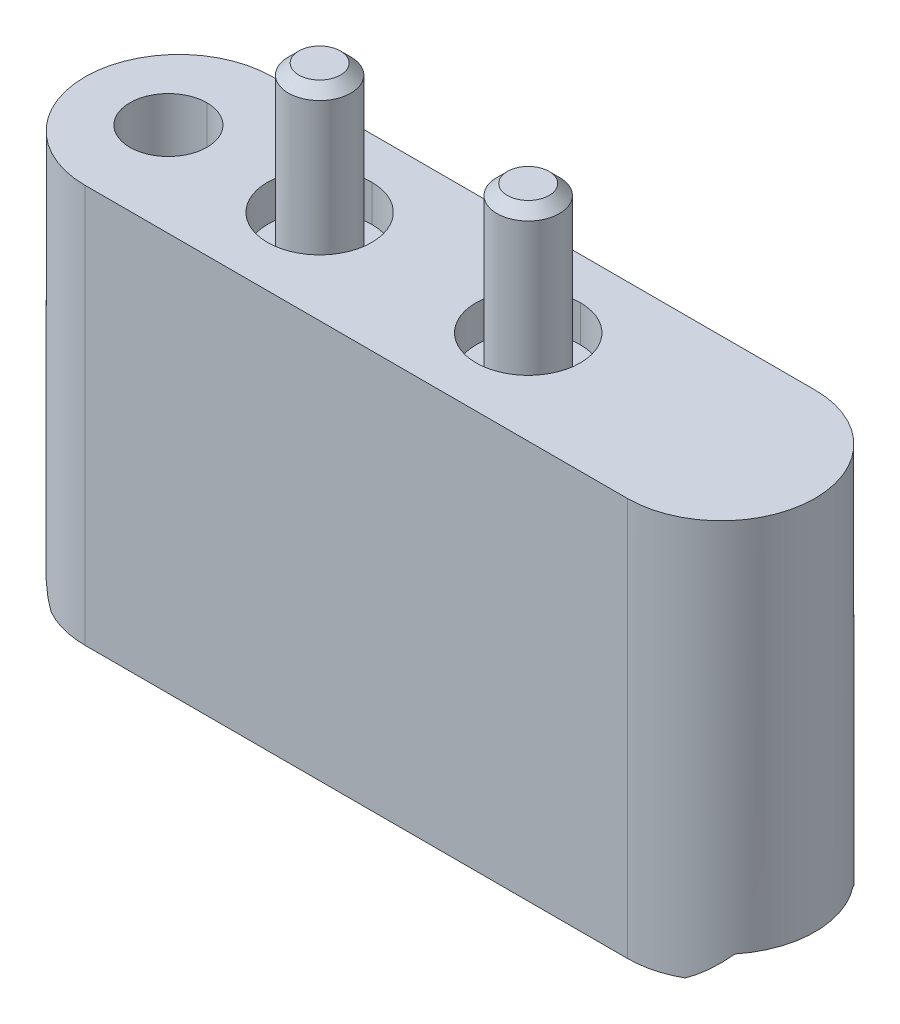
ISO-10303-21;
HEADER;
FILE_DESCRIPTION(('STEP AP214'),'2;1');
FILE_NAME('part.step','',(''),(''),'','','');
FILE_SCHEMA(('AUTOMOTIVE_DESIGN { 1 0 10303 214 1 1 1 1 }'));
ENDSEC;
DATA;
#1=APPLICATION_CONTEXT('core data for automotive mechanical design processes');
#2=APPLICATION_PROTOCOL_DEFINITION('international standard','automotive_design',2000,#1);
#3=PRODUCT_CONTEXT('',#1,'mechanical');
#4=PRODUCT('Part','Part','',(#3));
#5=PRODUCT_RELATED_PRODUCT_CATEGORY('part','',(#4));
#6=PRODUCT_DEFINITION_FORMATION('','',#4);
#7=PRODUCT_DEFINITION_CONTEXT('part definition',#1,'design');
#8=PRODUCT_DEFINITION('design','',#6,#7);
#9=PRODUCT_DEFINITION_SHAPE('','',#8);
#10=(LENGTH_UNIT() NAMED_UNIT(*) SI_UNIT(.MILLI.,.METRE.));
#11=(NAMED_UNIT(*) PLANE_ANGLE_UNIT() SI_UNIT($,.RADIAN.));
#12=(NAMED_UNIT(*) SI_UNIT($,.STERADIAN.) SOLID_ANGLE_UNIT());
#13=UNCERTAINTY_MEASURE_WITH_UNIT(LENGTH_MEASURE(1.E-05),#10,'distance_accuracy_value','');
#14=(GEOMETRIC_REPRESENTATION_CONTEXT(3) GLOBAL_UNCERTAINTY_ASSIGNED_CONTEXT((#13)) GLOBAL_UNIT_ASSIGNED_CONTEXT((#10,
#11,#12)) REPRESENTATION_CONTEXT('',''));
#15=CARTESIAN_POINT('',(0.,0.,0.));
#16=DIRECTION('',(0.,0.,1.));
#17=DIRECTION('',(1.,0.,0.));
#18=AXIS2_PLACEMENT_3D('',#15,#16,#17);
#19=CARTESIAN_POINT('',(-5.5,-14.,0.));
#20=DIRECTION('',(0.,1.,0.));
#21=DIRECTION('',(1.,0.,0.));
#22=AXIS2_PLACEMENT_3D('',#19,#20,#21);
#23=PLANE('',#22);
#24=CARTESIAN_POINT('',(18.,-14.,0.));
#25=DIRECTION('',(0.,1.,0.));
#26=DIRECTION('',(0.,0.,1.));
#27=AXIS2_PLACEMENT_3D('',#24,#25,#26);
#28=CIRCLE('',#27,3.7);
#29=CARTESIAN_POINT('',(15.4644444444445,-14.,-2.69461648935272));
#30=VERTEX_POINT('',#29);
#31=CARTESIAN_POINT('',(15.4644444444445,-14.,2.69461648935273));
#32=VERTEX_POINT('',#31);
#33=EDGE_CURVE('E492',#30,#32,#28,.T.);
#34=ORIENTED_EDGE('',*,*,#33,.F.);
#35=CARTESIAN_POINT('',(16.5,-14.,0.));
#36=DIRECTION('',(0.,1.,0.));
#37=DIRECTION('',(0.,0.,1.));
#38=AXIS2_PLACEMENT_3D('',#35,#36,#37);
#39=CIRCLE('',#38,2.88675134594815);
#40=EDGE_CURVE('E485',#30,#32,#39,.T.);
#41=ORIENTED_EDGE('',*,*,#40,.T.);
#42=EDGE_LOOP('',(#34,#41));
#43=FACE_BOUND('',#42,.T.);
#44=ADVANCED_FACE('F16',(#43),#23,.T.);
#45=CARTESIAN_POINT('',(-3.5,-14.,0.));
#46=DIRECTION('',(0.,-1.,0.));
#47=DIRECTION('',(1.,0.,0.));
#48=AXIS2_PLACEMENT_3D('',#45,#46,#47);
#49=CIRCLE('',#48,2.88675134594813);
#50=CARTESIAN_POINT('',(-2.51523809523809,-14.,2.71359122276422));
#51=VERTEX_POINT('',#50);
#52=CARTESIAN_POINT('',(-2.5152380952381,-14.,-2.71359122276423));
#53=VERTEX_POINT('',#52);
#54=EDGE_CURVE('E31',#51,#53,#49,.T.);
#55=ORIENTED_EDGE('',*,*,#54,.F.);
#56=CARTESIAN_POINT('',(0.,-14.,0.));
#57=DIRECTION('',(0.,1.,0.));
#58=DIRECTION('',(0.,0.,1.));
#59=AXIS2_PLACEMENT_3D('',#56,#57,#58);
#60=CIRCLE('',#59,3.7);
#61=EDGE_CURVE('E34',#53,#51,#60,.T.);
#62=ORIENTED_EDGE('',*,*,#61,.F.);
#63=EDGE_LOOP('',(#55,#62));
#64=FACE_BOUND('',#63,.T.);
#65=ADVANCED_FACE('F897',(#64),#23,.T.);
#66=CARTESIAN_POINT('',(36.,-15.,0.));
#67=DIRECTION('',(0.,1.,0.));
#68=DIRECTION('',(1.,0.,0.));
#69=AXIS2_PLACEMENT_3D('',#66,#67,#68);
#70=PLANE('',#69);
#71=CARTESIAN_POINT('',(36.,-15.,0.));
#72=DIRECTION('',(0.,1.,0.));
#73=DIRECTION('',(0.,0.,1.));
#74=AXIS2_PLACEMENT_3D('',#71,#72,#73);
#75=CIRCLE('',#74,2.7);
#76=CARTESIAN_POINT('',(36.,-15.,2.7));
#77=VERTEX_POINT('',#76);
#78=EDGE_CURVE('E739',#77,#77,#75,.F.);
#79=ORIENTED_EDGE('',*,*,#78,.F.);
#80=EDGE_LOOP('',(#79));
#81=FACE_BOUND('',#80,.T.);
#82=CARTESIAN_POINT('',(36.,-15.,0.));
#83=DIRECTION('',(0.,1.,0.));
#84=DIRECTION('',(0.,0.,1.));
#85=AXIS2_PLACEMENT_3D('',#82,#83,#84);
#86=CIRCLE('',#85,3.);
#87=CARTESIAN_POINT('',(36.,-15.,-3.));
#88=VERTEX_POINT('',#87);
#89=CARTESIAN_POINT('',(36.,-15.,3.));
#90=VERTEX_POINT('',#89);
#91=EDGE_CURVE('E527',#88,#90,#86,.T.);
#92=ORIENTED_EDGE('',*,*,#91,.F.);
#93=CARTESIAN_POINT('',(36.,-15.,0.));
#94=DIRECTION('',(0.,1.,0.));
#95=DIRECTION('',(0.,0.,1.));
#96=AXIS2_PLACEMENT_3D('',#93,#94,#95);
#97=CIRCLE('',#96,3.);
#98=EDGE_CURVE('E647',#90,#88,#97,.T.);
#99=ORIENTED_EDGE('',*,*,#98,.F.);
#100=EDGE_LOOP('',(#92,#99));
#101=FACE_BOUND('',#100,.T.);
#102=ADVANCED_FACE('F903',(#81,#101),#70,.F.);
#103=CARTESIAN_POINT('',(36.,-23.5,0.));
#104=DIRECTION('',(0.,1.,0.));
#105=DIRECTION('',(1.,0.,0.));
#106=AXIS2_PLACEMENT_3D('',#103,#104,#105);
#107=PLANE('',#106);
#108=CARTESIAN_POINT('',(36.,-23.5,0.));
#109=DIRECTION('',(0.,1.,0.));
#110=DIRECTION('',(0.,0.,1.));
#111=AXIS2_PLACEMENT_3D('',#108,#109,#110);
#112=CIRCLE('',#111,3.);
#113=CARTESIAN_POINT('',(36.,-23.5,-3.));
#114=VERTEX_POINT('',#113);
#115=CARTESIAN_POINT('',(36.,-23.5,3.));
#116=VERTEX_POINT('',#115);
#117=EDGE_CURVE('E707',#114,#116,#112,.T.);
#118=ORIENTED_EDGE('',*,*,#117,.T.);
#119=CARTESIAN_POINT('',(36.,-23.5,0.));
#120=DIRECTION('',(0.,1.,0.));
#121=DIRECTION('',(0.,0.,1.));
#122=AXIS2_PLACEMENT_3D('',#119,#120,#121);
#123=CIRCLE('',#122,3.);
#124=EDGE_CURVE('E602',#116,#114,#123,.T.);
#125=ORIENTED_EDGE('',*,*,#124,.T.);
#126=EDGE_LOOP('',(#118,#125));
#127=FACE_BOUND('',#126,.T.);
#128=CARTESIAN_POINT('',(36.,-23.5,0.));
#129=DIRECTION('',(0.,-1.,0.));
#130=DIRECTION('',(0.,0.,1.));
#131=AXIS2_PLACEMENT_3D('',#128,#129,#130);
#132=CIRCLE('',#131,3.7);
#133=CARTESIAN_POINT('',(36.,-23.5,-3.7));
#134=VERTEX_POINT('',#133);
#135=CARTESIAN_POINT('',(36.,-23.5,3.7));
#136=VERTEX_POINT('',#135);
#137=EDGE_CURVE('E595',#134,#136,#132,.T.);
#138=ORIENTED_EDGE('',*,*,#137,.T.);
#139=CARTESIAN_POINT('',(36.,-23.5,0.));
#140=DIRECTION('',(0.,-1.,0.));
#141=DIRECTION('',(0.,0.,1.));
#142=AXIS2_PLACEMENT_3D('',#139,#140,#141);
#143=CIRCLE('',#142,3.7);
#144=EDGE_CURVE('E581',#136,#134,#143,.T.);
#145=ORIENTED_EDGE('',*,*,#144,.T.);
#146=EDGE_LOOP('',(#138,#145));
#147=FACE_BOUND('',#146,.T.);
#148=ADVANCED_FACE('F915',(#127,#147),#107,.F.);
#149=CARTESIAN_POINT('',(36.,-36.,0.));
#150=DIRECTION('',(0.,-1.,0.));
#151=DIRECTION('',(0.,0.,-1.));
#152=AXIS2_PLACEMENT_3D('',#149,#150,#151);
#153=CONICAL_SURFACE('',#152,5.5,0.785398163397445);
#154=DIRECTION('',(0.,-0.70710678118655,0.707106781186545));
#155=VECTOR('',#154,1.);
#156=CARTESIAN_POINT('',(36.,-36.,5.5));
#157=LINE('',#156,#155);
#158=CARTESIAN_POINT('',(36.,-35.5,5.));
#159=VERTEX_POINT('',#158);
#160=CARTESIAN_POINT('',(36.,-36.,5.5));
#161=VERTEX_POINT('',#160);
#162=EDGE_CURVE('E684',#159,#161,#157,.T.);
#163=ORIENTED_EDGE('',*,*,#162,.F.);
#164=CARTESIAN_POINT('',(36.,-35.5,0.));
#165=DIRECTION('',(0.,-1.,0.));
#166=DIRECTION('',(0.,0.,1.));
#167=AXIS2_PLACEMENT_3D('',#164,#165,#166);
#168=CIRCLE('',#167,5.);
#169=CARTESIAN_POINT('',(36.,-35.5,-5.));
#170=VERTEX_POINT('',#169);
#171=EDGE_CURVE('E1029',#170,#159,#168,.T.);
#172=ORIENTED_EDGE('',*,*,#171,.F.);
#173=DIRECTION('',(0.,-0.70710678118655,-0.707106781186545));
#174=VECTOR('',#173,1.);
#175=CARTESIAN_POINT('',(36.,-36.,-5.5));
#176=LINE('',#175,#174);
#177=CARTESIAN_POINT('',(36.,-36.,-5.5));
#178=VERTEX_POINT('',#177);
#179=EDGE_CURVE('E548',#170,#178,#176,.T.);
#180=ORIENTED_EDGE('',*,*,#179,.T.);
#181=CARTESIAN_POINT('',(36.,-36.,0.));
#182=DIRECTION('',(0.,1.,0.));
#183=DIRECTION('',(0.,0.,1.));
#184=AXIS2_PLACEMENT_3D('',#181,#182,#183);
#185=CIRCLE('',#184,5.5);
#186=EDGE_CURVE('E638',#161,#178,#185,.T.);
#187=ORIENTED_EDGE('',*,*,#186,.F.);
#188=EDGE_LOOP('',(#163,#172,#180,#187));
#189=FACE_BOUND('',#188,.T.);
#190=ADVANCED_FACE('F970',(#189),#153,.F.);
#191=CARTESIAN_POINT('',(18.,-36.,0.));
#192=DIRECTION('',(0.,-1.,0.));
#193=DIRECTION('',(0.,0.,-1.));
#194=AXIS2_PLACEMENT_3D('',#191,#192,#193);
#195=CONICAL_SURFACE('',#194,5.5,0.785398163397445);
#196=DIRECTION('',(0.,-0.70710678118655,0.707106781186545));
#197=VECTOR('',#196,1.);
#198=CARTESIAN_POINT('',(18.,-36.,5.5));
#199=LINE('',#198,#197);
#200=CARTESIAN_POINT('',(18.,-35.5,5.));
#201=VERTEX_POINT('',#200);
#202=CARTESIAN_POINT('',(18.,-36.,5.5));
#203=VERTEX_POINT('',#202);
#204=EDGE_CURVE('E547',#201,#203,#199,.T.);
#205=ORIENTED_EDGE('',*,*,#204,.F.);
#206=CARTESIAN_POINT('',(18.,-35.5,0.));
#207=DIRECTION('',(0.,-1.,0.));
#208=DIRECTION('',(0.,0.,1.));
#209=AXIS2_PLACEMENT_3D('',#206,#207,#208);
#210=CIRCLE('',#209,5.);
#211=CARTESIAN_POINT('',(18.,-35.5,-5.));
#212=VERTEX_POINT('',#211);
#213=EDGE_CURVE('E1024',#212,#201,#210,.T.);
#214=ORIENTED_EDGE('',*,*,#213,.F.);
#215=DIRECTION('',(0.,-0.70710678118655,-0.707106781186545));
#216=VECTOR('',#215,1.);
#217=CARTESIAN_POINT('',(18.,-36.,-5.5));
#218=LINE('',#217,#216);
#219=CARTESIAN_POINT('',(18.,-36.,-5.5));
#220=VERTEX_POINT('',#219);
#221=EDGE_CURVE('E620',#212,#220,#218,.T.);
#222=ORIENTED_EDGE('',*,*,#221,.T.);
#223=CARTESIAN_POINT('',(18.,-36.,0.));
#224=DIRECTION('',(0.,1.,0.));
#225=DIRECTION('',(0.,0.,1.));
#226=AXIS2_PLACEMENT_3D('',#223,#224,#225);
#227=CIRCLE('',#226,5.5);
#228=EDGE_CURVE('E635',#203,#220,#227,.T.);
#229=ORIENTED_EDGE('',*,*,#228,.F.);
#230=EDGE_LOOP('',(#205,#214,#222,#229));
#231=FACE_BOUND('',#230,.T.);
#232=ADVANCED_FACE('F988',(#231),#195,.F.);
#233=CARTESIAN_POINT('',(0.,-36.,0.));
#234=DIRECTION('',(0.,-1.,0.));
#235=DIRECTION('',(0.,0.,-1.));
#236=AXIS2_PLACEMENT_3D('',#233,#234,#235);
#237=CONICAL_SURFACE('',#236,5.5,0.785398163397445);
#238=DIRECTION('',(0.,-0.70710678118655,0.707106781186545));
#239=VECTOR('',#238,1.);
#240=CARTESIAN_POINT('',(0.,-36.,5.5));
#241=LINE('',#240,#239);
#242=CARTESIAN_POINT('',(0.,-35.5,5.));
#243=VERTEX_POINT('',#242);
#244=CARTESIAN_POINT('',(0.,-36.,5.5));
#245=VERTEX_POINT('',#244);
#246=EDGE_CURVE('E603',#243,#245,#241,.T.);
#247=ORIENTED_EDGE('',*,*,#246,.F.);
#248=CARTESIAN_POINT('',(0.,-35.5,0.));
#249=DIRECTION('',(0.,-1.,0.));
#250=DIRECTION('',(0.,0.,1.));
#251=AXIS2_PLACEMENT_3D('',#248,#249,#250);
#252=CIRCLE('',#251,5.);
#253=CARTESIAN_POINT('',(0.,-35.5,-5.));
#254=VERTEX_POINT('',#253);
#255=EDGE_CURVE('E542',#254,#243,#252,.T.);
#256=ORIENTED_EDGE('',*,*,#255,.F.);
#257=DIRECTION('',(0.,-0.70710678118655,-0.707106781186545));
#258=VECTOR('',#257,1.);
#259=CARTESIAN_POINT('',(0.,-36.,-5.5));
#260=LINE('',#259,#258);
#261=CARTESIAN_POINT('',(0.,-36.,-5.5));
#262=VERTEX_POINT('',#261);
#263=EDGE_CURVE('E715',#254,#262,#260,.T.);
#264=ORIENTED_EDGE('',*,*,#263,.T.);
#265=CARTESIAN_POINT('',(0.,-36.,0.));
#266=DIRECTION('',(0.,1.,0.));
#267=DIRECTION('',(0.,0.,1.));
#268=AXIS2_PLACEMENT_3D('',#265,#266,#267);
#269=CIRCLE('',#268,5.5);
#270=EDGE_CURVE('E537',#245,#262,#269,.T.);
#271=ORIENTED_EDGE('',*,*,#270,.F.);
#272=EDGE_LOOP('',(#247,#256,#264,#271));
#273=FACE_BOUND('',#272,.T.);
#274=ADVANCED_FACE('F990',(#273),#237,.F.);
#275=CARTESIAN_POINT('',(0.,0.,0.));
#276=DIRECTION('',(0.,-1.,0.));
#277=DIRECTION('',(0.,0.,-1.));
#278=AXIS2_PLACEMENT_3D('',#275,#276,#277);
#279=CYLINDRICAL_SURFACE('',#278,3.7);
#280=DIRECTION('',(0.,-1.,0.));
#281=VECTOR('',#280,1.);
#282=CARTESIAN_POINT('',(0.,0.,3.7));
#283=LINE('',#282,#281);
#284=CARTESIAN_POINT('',(0.,-14.,3.7));
#285=VERTEX_POINT('',#284);
#286=CARTESIAN_POINT('',(0.,-25.5,3.7));
#287=VERTEX_POINT('',#286);
#288=EDGE_CURVE('E1089',#285,#287,#283,.T.);
#289=ORIENTED_EDGE('',*,*,#288,.F.);
#290=CARTESIAN_POINT('',(0.,-14.,0.));
#291=DIRECTION('',(0.,1.,0.));
#292=DIRECTION('',(0.,0.,1.));
#293=AXIS2_PLACEMENT_3D('',#290,#291,#292);
#294=CIRCLE('',#293,3.7);
#295=CARTESIAN_POINT('',(0.,-14.,-3.7));
#296=VERTEX_POINT('',#295);
#297=EDGE_CURVE('E656',#285,#296,#294,.T.);
#298=ORIENTED_EDGE('',*,*,#297,.T.);
#299=DIRECTION('',(0.,-1.,0.));
#300=VECTOR('',#299,1.);
#301=CARTESIAN_POINT('',(0.,0.,-3.7));
#302=LINE('',#301,#300);
#303=CARTESIAN_POINT('',(0.,-25.5,-3.7));
#304=VERTEX_POINT('',#303);
#305=EDGE_CURVE('E495',#296,#304,#302,.T.);
#306=ORIENTED_EDGE('',*,*,#305,.T.);
#307=CARTESIAN_POINT('',(0.,-25.5,0.));
#308=DIRECTION('',(0.,-1.,0.));
#309=DIRECTION('',(0.,0.,-1.));
#310=AXIS2_PLACEMENT_3D('',#307,#308,#309);
#311=CIRCLE('',#310,3.7);
#312=EDGE_CURVE('E743',#304,#287,#311,.T.);
#313=ORIENTED_EDGE('',*,*,#312,.T.);
#314=EDGE_LOOP('',(#289,#298,#306,#313));
#315=FACE_BOUND('',#314,.T.);
#316=ADVANCED_FACE('F1454',(#315),#279,.F.);
#317=CARTESIAN_POINT('',(0.,-25.5,0.));
#318=DIRECTION('',(0.,-1.,0.));
#319=DIRECTION('',(0.,0.,-1.));
#320=AXIS2_PLACEMENT_3D('',#317,#318,#319);
#321=PLANE('',#320);
#322=CARTESIAN_POINT('',(0.,-25.5,0.));
#323=DIRECTION('',(0.,1.,0.));
#324=DIRECTION('',(0.,0.,-1.));
#325=AXIS2_PLACEMENT_3D('',#322,#323,#324);
#326=CIRCLE('',#325,3.);
#327=CARTESIAN_POINT('',(0.,-25.5,-3.));
#328=VERTEX_POINT('',#327);
#329=CARTESIAN_POINT('',(0.,-25.5,3.));
#330=VERTEX_POINT('',#329);
#331=EDGE_CURVE('E1174',#328,#330,#326,.T.);
#332=ORIENTED_EDGE('',*,*,#331,.F.);
#333=CARTESIAN_POINT('',(0.,-25.5,0.));
#334=DIRECTION('',(0.,1.,0.));
#335=DIRECTION('',(0.,0.,-1.));
#336=AXIS2_PLACEMENT_3D('',#333,#334,#335);
#337=CIRCLE('',#336,3.);
#338=EDGE_CURVE('E538',#330,#328,#337,.T.);
#339=ORIENTED_EDGE('',*,*,#338,.F.);
#340=EDGE_LOOP('',(#332,#339));
#341=FACE_BOUND('',#340,.T.);
#342=ORIENTED_EDGE('',*,*,#312,.F.);
#343=CARTESIAN_POINT('',(0.,-25.5,0.));
#344=DIRECTION('',(0.,-1.,0.));
#345=DIRECTION('',(0.,0.,-1.));
#346=AXIS2_PLACEMENT_3D('',#343,#344,#345);
#347=CIRCLE('',#346,3.7);
#348=EDGE_CURVE('E520',#287,#304,#347,.T.);
#349=ORIENTED_EDGE('',*,*,#348,.F.);
#350=EDGE_LOOP('',(#342,#349));
#351=FACE_BOUND('',#350,.T.);
#352=ADVANCED_FACE('F1450',(#341,#351),#321,.F.);
#353=CARTESIAN_POINT('',(18.,0.,0.));
#354=DIRECTION('',(0.,-1.,0.));
#355=DIRECTION('',(0.,0.,-1.));
#356=AXIS2_PLACEMENT_3D('',#353,#354,#355);
#357=CYLINDRICAL_SURFACE('',#356,3.7);
#358=DIRECTION('',(0.,-1.,0.));
#359=VECTOR('',#358,1.);
#360=CARTESIAN_POINT('',(18.,0.,3.7));
#361=LINE('',#360,#359);
#362=CARTESIAN_POINT('',(18.,-14.,3.7));
#363=VERTEX_POINT('',#362);
#364=CARTESIAN_POINT('',(18.,-25.5,3.7));
#365=VERTEX_POINT('',#364);
#366=EDGE_CURVE('E503',#363,#365,#361,.T.);
#367=ORIENTED_EDGE('',*,*,#366,.F.);
#368=CARTESIAN_POINT('',(18.,-14.,0.));
#369=DIRECTION('',(0.,1.,0.));
#370=DIRECTION('',(0.,0.,1.));
#371=AXIS2_PLACEMENT_3D('',#368,#369,#370);
#372=CIRCLE('',#371,3.7);
#373=CARTESIAN_POINT('',(18.,-14.,-3.7));
#374=VERTEX_POINT('',#373);
#375=EDGE_CURVE('E685',#363,#374,#372,.T.);
#376=ORIENTED_EDGE('',*,*,#375,.T.);
#377=DIRECTION('',(0.,-1.,0.));
#378=VECTOR('',#377,1.);
#379=CARTESIAN_POINT('',(18.,0.,-3.7));
#380=LINE('',#379,#378);
#381=CARTESIAN_POINT('',(18.,-25.5,-3.7));
#382=VERTEX_POINT('',#381);
#383=EDGE_CURVE('E501',#374,#382,#380,.T.);
#384=ORIENTED_EDGE('',*,*,#383,.T.);
#385=CARTESIAN_POINT('',(18.,-25.5,0.));
#386=DIRECTION('',(0.,-1.,0.));
#387=DIRECTION('',(0.,0.,-1.));
#388=AXIS2_PLACEMENT_3D('',#385,#386,#387);
#389=CIRCLE('',#388,3.7);
#390=EDGE_CURVE('E738',#382,#365,#389,.T.);
#391=ORIENTED_EDGE('',*,*,#390,.T.);
#392=EDGE_LOOP('',(#367,#376,#384,#391));
#393=FACE_BOUND('',#392,.T.);
#394=ADVANCED_FACE('F1453',(#393),#357,.F.);
#395=CARTESIAN_POINT('',(18.,-25.5,0.));
#396=DIRECTION('',(0.,-1.,0.));
#397=DIRECTION('',(0.,0.,-1.));
#398=AXIS2_PLACEMENT_3D('',#395,#396,#397);
#399=PLANE('',#398);
#400=CARTESIAN_POINT('',(18.,-25.5,0.));
#401=DIRECTION('',(0.,1.,0.));
#402=DIRECTION('',(0.,0.,-1.));
#403=AXIS2_PLACEMENT_3D('',#400,#401,#402);
#404=CIRCLE('',#403,3.);
#405=CARTESIAN_POINT('',(18.,-25.5,-3.));
#406=VERTEX_POINT('',#405);
#407=CARTESIAN_POINT('',(18.,-25.5,3.));
#408=VERTEX_POINT('',#407);
#409=EDGE_CURVE('E553',#406,#408,#404,.T.);
#410=ORIENTED_EDGE('',*,*,#409,.F.);
#411=CARTESIAN_POINT('',(18.,-25.5,0.));
#412=DIRECTION('',(0.,1.,0.));
#413=DIRECTION('',(0.,0.,-1.));
#414=AXIS2_PLACEMENT_3D('',#411,#412,#413);
#415=CIRCLE('',#414,3.);
#416=EDGE_CURVE('E541',#408,#406,#415,.T.);
#417=ORIENTED_EDGE('',*,*,#416,.F.);
#418=EDGE_LOOP('',(#410,#417));
#419=FACE_BOUND('',#418,.T.);
#420=ORIENTED_EDGE('',*,*,#390,.F.);
#421=CARTESIAN_POINT('',(18.,-25.5,0.));
#422=DIRECTION('',(0.,-1.,0.));
#423=DIRECTION('',(0.,0.,-1.));
#424=AXIS2_PLACEMENT_3D('',#421,#422,#423);
#425=CIRCLE('',#424,3.7);
#426=EDGE_CURVE('E511',#365,#382,#425,.T.);
#427=ORIENTED_EDGE('',*,*,#426,.F.);
#428=EDGE_LOOP('',(#420,#427));
#429=FACE_BOUND('',#428,.T.);
#430=ADVANCED_FACE('F1003',(#419,#429),#399,.F.);
#431=CARTESIAN_POINT('',(36.,-25.5,0.));
#432=DIRECTION('',(0.,-1.,0.));
#433=DIRECTION('',(0.,0.,-1.));
#434=AXIS2_PLACEMENT_3D('',#431,#432,#433);
#435=PLANE('',#434);
#436=CARTESIAN_POINT('',(36.,-25.5,0.));
#437=DIRECTION('',(0.,1.,0.));
#438=DIRECTION('',(0.,0.,-1.));
#439=AXIS2_PLACEMENT_3D('',#436,#437,#438);
#440=CIRCLE('',#439,3.);
#441=CARTESIAN_POINT('',(36.,-25.5,-3.));
#442=VERTEX_POINT('',#441);
#443=CARTESIAN_POINT('',(36.,-25.5,3.));
#444=VERTEX_POINT('',#443);
#445=EDGE_CURVE('E580',#442,#444,#440,.T.);
#446=ORIENTED_EDGE('',*,*,#445,.F.);
#447=CARTESIAN_POINT('',(36.,-25.5,0.));
#448=DIRECTION('',(0.,1.,0.));
#449=DIRECTION('',(0.,0.,-1.));
#450=AXIS2_PLACEMENT_3D('',#447,#448,#449);
#451=CIRCLE('',#450,3.);
#452=EDGE_CURVE('E735',#444,#442,#451,.T.);
#453=ORIENTED_EDGE('',*,*,#452,.F.);
#454=EDGE_LOOP('',(#446,#453));
#455=FACE_BOUND('',#454,.T.);
#456=CARTESIAN_POINT('',(36.,-25.5,0.));
#457=DIRECTION('',(0.,-1.,0.));
#458=DIRECTION('',(0.,0.,-1.));
#459=AXIS2_PLACEMENT_3D('',#456,#457,#458);
#460=CIRCLE('',#459,3.7);
#461=CARTESIAN_POINT('',(36.,-25.5,-3.7));
#462=VERTEX_POINT('',#461);
#463=CARTESIAN_POINT('',(36.,-25.5,3.7));
#464=VERTEX_POINT('',#463);
#465=EDGE_CURVE('E601',#462,#464,#460,.T.);
#466=ORIENTED_EDGE('',*,*,#465,.F.);
#467=CARTESIAN_POINT('',(36.,-25.5,0.));
#468=DIRECTION('',(0.,-1.,0.));
#469=DIRECTION('',(0.,0.,-1.));
#470=AXIS2_PLACEMENT_3D('',#467,#468,#469);
#471=CIRCLE('',#470,3.7);
#472=EDGE_CURVE('E661',#464,#462,#471,.T.);
#473=ORIENTED_EDGE('',*,*,#472,.F.);
#474=EDGE_LOOP('',(#466,#473));
#475=FACE_BOUND('',#474,.T.);
#476=ADVANCED_FACE('F966',(#455,#475),#435,.F.);
#477=CARTESIAN_POINT('',(36.,-25.5,0.));
#478=DIRECTION('',(0.,-1.,0.));
#479=DIRECTION('',(0.,0.,-1.));
#480=AXIS2_PLACEMENT_3D('',#477,#478,#479);
#481=CYLINDRICAL_SURFACE('',#480,3.);
#482=DIRECTION('',(0.,-1.,0.));
#483=VECTOR('',#482,1.);
#484=CARTESIAN_POINT('',(36.,-25.5,3.));
#485=LINE('',#484,#483);
#486=CARTESIAN_POINT('',(36.,-27.5,3.));
#487=VERTEX_POINT('',#486);
#488=EDGE_CURVE('E576',#444,#487,#485,.T.);
#489=ORIENTED_EDGE('',*,*,#488,.F.);
#490=ORIENTED_EDGE('',*,*,#452,.T.);
#491=DIRECTION('',(0.,-1.,0.));
#492=VECTOR('',#491,1.);
#493=CARTESIAN_POINT('',(36.,-25.5,-3.));
#494=LINE('',#493,#492);
#495=CARTESIAN_POINT('',(36.,-27.5,-3.));
#496=VERTEX_POINT('',#495);
#497=EDGE_CURVE('E549',#442,#496,#494,.T.);
#498=ORIENTED_EDGE('',*,*,#497,.T.);
#499=CARTESIAN_POINT('',(36.,-27.5,0.));
#500=DIRECTION('',(0.,-1.,0.));
#501=DIRECTION('',(0.,0.,-1.));
#502=AXIS2_PLACEMENT_3D('',#499,#500,#501);
#503=CIRCLE('',#502,3.);
#504=EDGE_CURVE('E1026',#496,#487,#503,.T.);
#505=ORIENTED_EDGE('',*,*,#504,.T.);
#506=EDGE_LOOP('',(#489,#490,#498,#505));
#507=FACE_BOUND('',#506,.T.);
#508=ADVANCED_FACE('F962',(#507),#481,.F.);
#509=CARTESIAN_POINT('',(18.,-25.5,0.));
#510=DIRECTION('',(0.,-1.,0.));
#511=DIRECTION('',(0.,0.,-1.));
#512=AXIS2_PLACEMENT_3D('',#509,#510,#511);
#513=CYLINDRICAL_SURFACE('',#512,3.);
#514=DIRECTION('',(0.,-1.,0.));
#515=VECTOR('',#514,1.);
#516=CARTESIAN_POINT('',(18.,-25.5,3.));
#517=LINE('',#516,#515);
#518=CARTESIAN_POINT('',(18.,-27.5,3.));
#519=VERTEX_POINT('',#518);
#520=EDGE_CURVE('E616',#408,#519,#517,.T.);
#521=ORIENTED_EDGE('',*,*,#520,.F.);
#522=ORIENTED_EDGE('',*,*,#416,.T.);
#523=DIRECTION('',(0.,-1.,0.));
#524=VECTOR('',#523,1.);
#525=CARTESIAN_POINT('',(18.,-25.5,-3.));
#526=LINE('',#525,#524);
#527=CARTESIAN_POINT('',(18.,-27.5,-3.));
#528=VERTEX_POINT('',#527);
#529=EDGE_CURVE('E731',#406,#528,#526,.T.);
#530=ORIENTED_EDGE('',*,*,#529,.T.);
#531=CARTESIAN_POINT('',(18.,-27.5,0.));
#532=DIRECTION('',(0.,-1.,0.));
#533=DIRECTION('',(0.,0.,-1.));
#534=AXIS2_PLACEMENT_3D('',#531,#532,#533);
#535=CIRCLE('',#534,3.);
#536=EDGE_CURVE('E1008',#528,#519,#535,.T.);
#537=ORIENTED_EDGE('',*,*,#536,.T.);
#538=EDGE_LOOP('',(#521,#522,#530,#537));
#539=FACE_BOUND('',#538,.T.);
#540=ADVANCED_FACE('F965',(#539),#513,.F.);
#541=CARTESIAN_POINT('',(0.,-25.5,0.));
#542=DIRECTION('',(0.,-1.,0.));
#543=DIRECTION('',(0.,0.,-1.));
#544=AXIS2_PLACEMENT_3D('',#541,#542,#543);
#545=CYLINDRICAL_SURFACE('',#544,3.);
#546=DIRECTION('',(0.,-1.,0.));
#547=VECTOR('',#546,1.);
#548=CARTESIAN_POINT('',(0.,-25.5,3.));
#549=LINE('',#548,#547);
#550=CARTESIAN_POINT('',(0.,-27.5,3.));
#551=VERTEX_POINT('',#550);
#552=EDGE_CURVE('E1178',#330,#551,#549,.T.);
#553=ORIENTED_EDGE('',*,*,#552,.F.);
#554=ORIENTED_EDGE('',*,*,#338,.T.);
#555=DIRECTION('',(0.,-1.,0.));
#556=VECTOR('',#555,1.);
#557=CARTESIAN_POINT('',(0.,-25.5,-3.));
#558=LINE('',#557,#556);
#559=CARTESIAN_POINT('',(0.,-27.5,-3.));
#560=VERTEX_POINT('',#559);
#561=EDGE_CURVE('E1068',#328,#560,#558,.T.);
#562=ORIENTED_EDGE('',*,*,#561,.T.);
#563=CARTESIAN_POINT('',(0.,-27.5,0.));
#564=DIRECTION('',(0.,-1.,0.));
#565=DIRECTION('',(0.,0.,-1.));
#566=AXIS2_PLACEMENT_3D('',#563,#564,#565);
#567=CIRCLE('',#566,3.);
#568=EDGE_CURVE('E555',#560,#551,#567,.T.);
#569=ORIENTED_EDGE('',*,*,#568,.T.);
#570=EDGE_LOOP('',(#553,#554,#562,#569));
#571=FACE_BOUND('',#570,.T.);
#572=ADVANCED_FACE('F1429',(#571),#545,.F.);
#573=CARTESIAN_POINT('',(0.,-27.5,0.));
#574=DIRECTION('',(0.,-1.,0.));
#575=DIRECTION('',(0.,0.,-1.));
#576=AXIS2_PLACEMENT_3D('',#573,#574,#575);
#577=CYLINDRICAL_SURFACE('',#576,5.);
#578=DIRECTION('',(0.,-1.,0.));
#579=VECTOR('',#578,1.);
#580=CARTESIAN_POINT('',(0.,-27.5,5.));
#581=LINE('',#580,#579);
#582=CARTESIAN_POINT('',(0.,-27.5,5.));
#583=VERTEX_POINT('',#582);
#584=EDGE_CURVE('E1080',#583,#243,#581,.T.);
#585=ORIENTED_EDGE('',*,*,#584,.F.);
#586=CARTESIAN_POINT('',(0.,-27.5,0.));
#587=DIRECTION('',(0.,1.,0.));
#588=DIRECTION('',(0.,0.,1.));
#589=AXIS2_PLACEMENT_3D('',#586,#587,#588);
#590=CIRCLE('',#589,5.);
#591=CARTESIAN_POINT('',(0.,-27.5,-5.));
#592=VERTEX_POINT('',#591);
#593=EDGE_CURVE('E558',#583,#592,#590,.T.);
#594=ORIENTED_EDGE('',*,*,#593,.T.);
#595=DIRECTION('',(0.,-1.,0.));
#596=VECTOR('',#595,1.);
#597=CARTESIAN_POINT('',(0.,-27.5,-5.));
#598=LINE('',#597,#596);
#599=EDGE_CURVE('E526',#592,#254,#598,.T.);
#600=ORIENTED_EDGE('',*,*,#599,.T.);
#601=ORIENTED_EDGE('',*,*,#255,.T.);
#602=EDGE_LOOP('',(#585,#594,#600,#601));
#603=FACE_BOUND('',#602,.T.);
#604=ADVANCED_FACE('F1432',(#603),#577,.F.);
#605=CARTESIAN_POINT('',(0.,-27.5,0.));
#606=DIRECTION('',(0.,1.,0.));
#607=DIRECTION('',(1.,0.,0.));
#608=AXIS2_PLACEMENT_3D('',#605,#606,#607);
#609=PLANE('',#608);
#610=ORIENTED_EDGE('',*,*,#568,.F.);
#611=CARTESIAN_POINT('',(0.,-27.5,0.));
#612=DIRECTION('',(0.,-1.,0.));
#613=DIRECTION('',(0.,0.,-1.));
#614=AXIS2_PLACEMENT_3D('',#611,#612,#613);
#615=CIRCLE('',#614,3.);
#616=EDGE_CURVE('E1073',#551,#560,#615,.T.);
#617=ORIENTED_EDGE('',*,*,#616,.F.);
#618=EDGE_LOOP('',(#610,#617));
#619=FACE_BOUND('',#618,.T.);
#620=CARTESIAN_POINT('',(0.,-27.5,0.));
#621=DIRECTION('',(0.,1.,0.));
#622=DIRECTION('',(0.,0.,1.));
#623=AXIS2_PLACEMENT_3D('',#620,#621,#622);
#624=CIRCLE('',#623,5.);
#625=EDGE_CURVE('E1072',#592,#583,#624,.T.);
#626=ORIENTED_EDGE('',*,*,#625,.F.);
#627=ORIENTED_EDGE('',*,*,#593,.F.);
#628=EDGE_LOOP('',(#626,#627));
#629=FACE_BOUND('',#628,.T.);
#630=ADVANCED_FACE('F1498',(#619,#629),#609,.F.);
#631=CARTESIAN_POINT('',(18.,-27.5,0.));
#632=DIRECTION('',(0.,-1.,0.));
#633=DIRECTION('',(0.,0.,-1.));
#634=AXIS2_PLACEMENT_3D('',#631,#632,#633);
#635=CYLINDRICAL_SURFACE('',#634,5.);
#636=DIRECTION('',(0.,-1.,0.));
#637=VECTOR('',#636,1.);
#638=CARTESIAN_POINT('',(18.,-27.5,5.));
#639=LINE('',#638,#637);
#640=CARTESIAN_POINT('',(18.,-27.5,5.));
#641=VERTEX_POINT('',#640);
#642=EDGE_CURVE('E525',#641,#201,#639,.T.);
#643=ORIENTED_EDGE('',*,*,#642,.F.);
#644=CARTESIAN_POINT('',(18.,-27.5,0.));
#645=DIRECTION('',(0.,1.,0.));
#646=DIRECTION('',(0.,0.,1.));
#647=AXIS2_PLACEMENT_3D('',#644,#645,#646);
#648=CIRCLE('',#647,5.);
#649=CARTESIAN_POINT('',(18.,-27.5,-5.));
#650=VERTEX_POINT('',#649);
#651=EDGE_CURVE('E1025',#641,#650,#648,.T.);
#652=ORIENTED_EDGE('',*,*,#651,.T.);
#653=DIRECTION('',(0.,-1.,0.));
#654=VECTOR('',#653,1.);
#655=CARTESIAN_POINT('',(18.,-27.5,-5.));
#656=LINE('',#655,#654);
#657=EDGE_CURVE('E625',#650,#212,#656,.T.);
#658=ORIENTED_EDGE('',*,*,#657,.T.);
#659=ORIENTED_EDGE('',*,*,#213,.T.);
#660=EDGE_LOOP('',(#643,#652,#658,#659));
#661=FACE_BOUND('',#660,.T.);
#662=ADVANCED_FACE('F1427',(#661),#635,.F.);
#663=CARTESIAN_POINT('',(18.,-27.5,0.));
#664=DIRECTION('',(0.,1.,0.));
#665=DIRECTION('',(1.,0.,0.));
#666=AXIS2_PLACEMENT_3D('',#663,#664,#665);
#667=PLANE('',#666);
#668=ORIENTED_EDGE('',*,*,#536,.F.);
#669=CARTESIAN_POINT('',(18.,-27.5,0.));
#670=DIRECTION('',(0.,-1.,0.));
#671=DIRECTION('',(0.,0.,-1.));
#672=AXIS2_PLACEMENT_3D('',#669,#670,#671);
#673=CIRCLE('',#672,3.);
#674=EDGE_CURVE('E727',#519,#528,#673,.T.);
#675=ORIENTED_EDGE('',*,*,#674,.F.);
#676=EDGE_LOOP('',(#668,#675));
#677=FACE_BOUND('',#676,.T.);
#678=CARTESIAN_POINT('',(18.,-27.5,0.));
#679=DIRECTION('',(0.,1.,0.));
#680=DIRECTION('',(0.,0.,1.));
#681=AXIS2_PLACEMENT_3D('',#678,#679,#680);
#682=CIRCLE('',#681,5.);
#683=EDGE_CURVE('E521',#650,#641,#682,.T.);
#684=ORIENTED_EDGE('',*,*,#683,.F.);
#685=ORIENTED_EDGE('',*,*,#651,.F.);
#686=EDGE_LOOP('',(#684,#685));
#687=FACE_BOUND('',#686,.T.);
#688=ADVANCED_FACE('F1424',(#677,#687),#667,.F.);
#689=CARTESIAN_POINT('',(36.,-27.5,0.));
#690=DIRECTION('',(0.,-1.,0.));
#691=DIRECTION('',(0.,0.,-1.));
#692=AXIS2_PLACEMENT_3D('',#689,#690,#691);
#693=CYLINDRICAL_SURFACE('',#692,5.);
#694=DIRECTION('',(0.,-1.,0.));
#695=VECTOR('',#694,1.);
#696=CARTESIAN_POINT('',(36.,-27.5,5.));
#697=LINE('',#696,#695);
#698=CARTESIAN_POINT('',(36.,-27.5,5.));
#699=VERTEX_POINT('',#698);
#700=EDGE_CURVE('E698',#699,#159,#697,.T.);
#701=ORIENTED_EDGE('',*,*,#700,.F.);
#702=CARTESIAN_POINT('',(36.,-27.5,0.));
#703=DIRECTION('',(0.,1.,0.));
#704=DIRECTION('',(0.,0.,1.));
#705=AXIS2_PLACEMENT_3D('',#702,#703,#704);
#706=CIRCLE('',#705,5.);
#707=CARTESIAN_POINT('',(36.,-27.5,-5.));
#708=VERTEX_POINT('',#707);
#709=EDGE_CURVE('E1030',#699,#708,#706,.T.);
#710=ORIENTED_EDGE('',*,*,#709,.T.);
#711=DIRECTION('',(0.,-1.,0.));
#712=VECTOR('',#711,1.);
#713=CARTESIAN_POINT('',(36.,-27.5,-5.));
#714=LINE('',#713,#712);
#715=EDGE_CURVE('E693',#708,#170,#714,.T.);
#716=ORIENTED_EDGE('',*,*,#715,.T.);
#717=ORIENTED_EDGE('',*,*,#171,.T.);
#718=EDGE_LOOP('',(#701,#710,#716,#717));
#719=FACE_BOUND('',#718,.T.);
#720=ADVANCED_FACE('F948',(#719),#693,.F.);
#721=CARTESIAN_POINT('',(36.,-27.5,0.));
#722=DIRECTION('',(0.,1.,0.));
#723=DIRECTION('',(1.,0.,0.));
#724=AXIS2_PLACEMENT_3D('',#721,#722,#723);
#725=PLANE('',#724);
#726=ORIENTED_EDGE('',*,*,#504,.F.);
#727=CARTESIAN_POINT('',(36.,-27.5,0.));
#728=DIRECTION('',(0.,-1.,0.));
#729=DIRECTION('',(0.,0.,-1.));
#730=AXIS2_PLACEMENT_3D('',#727,#728,#729);
#731=CIRCLE('',#730,3.);
#732=EDGE_CURVE('E554',#487,#496,#731,.T.);
#733=ORIENTED_EDGE('',*,*,#732,.F.);
#734=EDGE_LOOP('',(#726,#733));
#735=FACE_BOUND('',#734,.T.);
#736=CARTESIAN_POINT('',(36.,-27.5,0.));
#737=DIRECTION('',(0.,1.,0.));
#738=DIRECTION('',(0.,0.,1.));
#739=AXIS2_PLACEMENT_3D('',#736,#737,#738);
#740=CIRCLE('',#739,5.);
#741=EDGE_CURVE('E629',#708,#699,#740,.T.);
#742=ORIENTED_EDGE('',*,*,#741,.F.);
#743=ORIENTED_EDGE('',*,*,#709,.F.);
#744=EDGE_LOOP('',(#742,#743));
#745=FACE_BOUND('',#744,.T.);
#746=ADVANCED_FACE('F944',(#735,#745),#725,.F.);
#747=CARTESIAN_POINT('',(-18.,-36.,0.));
#748=DIRECTION('',(0.,-1.,0.));
#749=DIRECTION('',(0.,0.,-1.));
#750=AXIS2_PLACEMENT_3D('',#747,#748,#749);
#751=CONICAL_SURFACE('',#750,5.5,0.785398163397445);
#752=DIRECTION('',(0.,-0.70710678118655,0.707106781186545));
#753=VECTOR('',#752,1.);
#754=CARTESIAN_POINT('',(-18.,-36.,5.5));
#755=LINE('',#754,#753);
#756=CARTESIAN_POINT('',(-18.,-35.5,5.));
#757=VERTEX_POINT('',#756);
#758=CARTESIAN_POINT('',(-18.,-36.,5.5));
#759=VERTEX_POINT('',#758);
#760=EDGE_CURVE('E1018',#757,#759,#755,.T.);
#761=ORIENTED_EDGE('',*,*,#760,.F.);
#762=CARTESIAN_POINT('',(-18.,-35.5,0.));
#763=DIRECTION('',(0.,-1.,0.));
#764=DIRECTION('',(0.,0.,1.));
#765=AXIS2_PLACEMENT_3D('',#762,#763,#764);
#766=CIRCLE('',#765,5.);
#767=CARTESIAN_POINT('',(-18.,-35.5,-5.));
#768=VERTEX_POINT('',#767);
#769=EDGE_CURVE('E515',#768,#757,#766,.T.);
#770=ORIENTED_EDGE('',*,*,#769,.F.);
#771=DIRECTION('',(0.,-0.70710678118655,-0.707106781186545));
#772=VECTOR('',#771,1.);
#773=CARTESIAN_POINT('',(-18.,-36.,-5.5));
#774=LINE('',#773,#772);
#775=CARTESIAN_POINT('',(-18.,-36.,-5.5));
#776=VERTEX_POINT('',#775);
#777=EDGE_CURVE('E559',#768,#776,#774,.T.);
#778=ORIENTED_EDGE('',*,*,#777,.T.);
#779=CARTESIAN_POINT('',(-18.,-36.,0.));
#780=DIRECTION('',(0.,1.,0.));
#781=DIRECTION('',(0.,0.,1.));
#782=AXIS2_PLACEMENT_3D('',#779,#780,#781);
#783=CIRCLE('',#782,5.5);
#784=EDGE_CURVE('E533',#759,#776,#783,.T.);
#785=ORIENTED_EDGE('',*,*,#784,.F.);
#786=EDGE_LOOP('',(#761,#770,#778,#785));
#787=FACE_BOUND('',#786,.T.);
#788=ADVANCED_FACE('F947',(#787),#751,.F.);
#789=CARTESIAN_POINT('',(-18.,0.,0.));
#790=DIRECTION('',(0.,-1.,0.));
#791=DIRECTION('',(0.,0.,-1.));
#792=AXIS2_PLACEMENT_3D('',#789,#790,#791);
#793=CYLINDRICAL_SURFACE('',#792,3.7);
#794=DIRECTION('',(0.,-1.,0.));
#795=VECTOR('',#794,1.);
#796=CARTESIAN_POINT('',(-18.,0.,3.7));
#797=LINE('',#796,#795);
#798=CARTESIAN_POINT('',(-18.,0.,3.7));
#799=VERTEX_POINT('',#798);
#800=CARTESIAN_POINT('',(-18.,-25.5,3.7));
#801=VERTEX_POINT('',#800);
#802=EDGE_CURVE('E1037',#799,#801,#797,.T.);
#803=ORIENTED_EDGE('',*,*,#802,.F.);
#804=CARTESIAN_POINT('',(-18.,0.,0.));
#805=DIRECTION('',(0.,-1.,0.));
#806=DIRECTION('',(0.,0.,-1.));
#807=AXIS2_PLACEMENT_3D('',#804,#805,#806);
#808=CIRCLE('',#807,3.7);
#809=CARTESIAN_POINT('',(-18.,0.,-3.7));
#810=VERTEX_POINT('',#809);
#811=EDGE_CURVE('E653',#810,#799,#808,.T.);
#812=ORIENTED_EDGE('',*,*,#811,.F.);
#813=DIRECTION('',(0.,-1.,0.));
#814=VECTOR('',#813,1.);
#815=CARTESIAN_POINT('',(-18.,0.,-3.7));
#816=LINE('',#815,#814);
#817=CARTESIAN_POINT('',(-18.,-25.5,-3.7));
#818=VERTEX_POINT('',#817);
#819=EDGE_CURVE('E575',#810,#818,#816,.T.);
#820=ORIENTED_EDGE('',*,*,#819,.T.);
#821=CARTESIAN_POINT('',(-18.,-25.5,0.));
#822=DIRECTION('',(0.,-1.,0.));
#823=DIRECTION('',(0.,0.,-1.));
#824=AXIS2_PLACEMENT_3D('',#821,#822,#823);
#825=CIRCLE('',#824,3.7);
#826=EDGE_CURVE('E1045',#818,#801,#825,.T.);
#827=ORIENTED_EDGE('',*,*,#826,.T.);
#828=EDGE_LOOP('',(#803,#812,#820,#827));
#829=FACE_BOUND('',#828,.T.);
#830=ADVANCED_FACE('F1442',(#829),#793,.F.);
#831=CARTESIAN_POINT('',(-18.,-25.5,0.));
#832=DIRECTION('',(0.,-1.,0.));
#833=DIRECTION('',(0.,0.,-1.));
#834=AXIS2_PLACEMENT_3D('',#831,#832,#833);
#835=PLANE('',#834);
#836=CARTESIAN_POINT('',(-18.,-25.5,0.));
#837=DIRECTION('',(0.,1.,0.));
#838=DIRECTION('',(0.,0.,-1.));
#839=AXIS2_PLACEMENT_3D('',#836,#837,#838);
#840=CIRCLE('',#839,3.);
#841=CARTESIAN_POINT('',(-18.,-25.5,-3.));
#842=VERTEX_POINT('',#841);
#843=CARTESIAN_POINT('',(-18.,-25.5,3.));
#844=VERTEX_POINT('',#843);
#845=EDGE_CURVE('E570',#842,#844,#840,.T.);
#846=ORIENTED_EDGE('',*,*,#845,.F.);
#847=CARTESIAN_POINT('',(-18.,-25.5,0.));
#848=DIRECTION('',(0.,1.,0.));
#849=DIRECTION('',(0.,0.,-1.));
#850=AXIS2_PLACEMENT_3D('',#847,#848,#849);
#851=CIRCLE('',#850,3.);
#852=EDGE_CURVE('E1042',#844,#842,#851,.T.);
#853=ORIENTED_EDGE('',*,*,#852,.F.);
#854=EDGE_LOOP('',(#846,#853));
#855=FACE_BOUND('',#854,.T.);
#856=ORIENTED_EDGE('',*,*,#826,.F.);
#857=CARTESIAN_POINT('',(-18.,-25.5,0.));
#858=DIRECTION('',(0.,-1.,0.));
#859=DIRECTION('',(0.,0.,-1.));
#860=AXIS2_PLACEMENT_3D('',#857,#858,#859);
#861=CIRCLE('',#860,3.7);
#862=EDGE_CURVE('E714',#801,#818,#861,.T.);
#863=ORIENTED_EDGE('',*,*,#862,.F.);
#864=EDGE_LOOP('',(#856,#863));
#865=FACE_BOUND('',#864,.T.);
#866=ADVANCED_FACE('F954',(#855,#865),#835,.F.);
#867=CARTESIAN_POINT('',(-18.,-25.5,0.));
#868=DIRECTION('',(0.,-1.,0.));
#869=DIRECTION('',(0.,0.,-1.));
#870=AXIS2_PLACEMENT_3D('',#867,#868,#869);
#871=CYLINDRICAL_SURFACE('',#870,3.);
#872=DIRECTION('',(0.,-1.,0.));
#873=VECTOR('',#872,1.);
#874=CARTESIAN_POINT('',(-18.,-25.5,3.));
#875=LINE('',#874,#873);
#876=CARTESIAN_POINT('',(-18.,-27.5,3.));
#877=VERTEX_POINT('',#876);
#878=EDGE_CURVE('E574',#844,#877,#875,.T.);
#879=ORIENTED_EDGE('',*,*,#878,.F.);
#880=ORIENTED_EDGE('',*,*,#852,.T.);
#881=DIRECTION('',(0.,-1.,0.));
#882=VECTOR('',#881,1.);
#883=CARTESIAN_POINT('',(-18.,-25.5,-3.));
#884=LINE('',#883,#882);
#885=CARTESIAN_POINT('',(-18.,-27.5,-3.));
#886=VERTEX_POINT('',#885);
#887=EDGE_CURVE('E639',#842,#886,#884,.T.);
#888=ORIENTED_EDGE('',*,*,#887,.T.);
#889=CARTESIAN_POINT('',(-18.,-27.5,0.));
#890=DIRECTION('',(0.,-1.,0.));
#891=DIRECTION('',(0.,0.,-1.));
#892=AXIS2_PLACEMENT_3D('',#889,#890,#891);
#893=CIRCLE('',#892,3.);
#894=EDGE_CURVE('E1096',#886,#877,#893,.T.);
#895=ORIENTED_EDGE('',*,*,#894,.T.);
#896=EDGE_LOOP('',(#879,#880,#888,#895));
#897=FACE_BOUND('',#896,.T.);
#898=ADVANCED_FACE('F950',(#897),#871,.F.);
#899=CARTESIAN_POINT('',(-18.,-27.5,0.));
#900=DIRECTION('',(0.,-1.,0.));
#901=DIRECTION('',(0.,0.,-1.));
#902=AXIS2_PLACEMENT_3D('',#899,#900,#901);
#903=CYLINDRICAL_SURFACE('',#902,5.);
#904=DIRECTION('',(0.,-1.,0.));
#905=VECTOR('',#904,1.);
#906=CARTESIAN_POINT('',(-18.,-27.5,5.));
#907=LINE('',#906,#905);
#908=CARTESIAN_POINT('',(-18.,-27.5,5.));
#909=VERTEX_POINT('',#908);
#910=EDGE_CURVE('E679',#909,#757,#907,.T.);
#911=ORIENTED_EDGE('',*,*,#910,.F.);
#912=CARTESIAN_POINT('',(-18.,-27.5,0.));
#913=DIRECTION('',(0.,1.,0.));
#914=DIRECTION('',(0.,0.,1.));
#915=AXIS2_PLACEMENT_3D('',#912,#913,#914);
#916=CIRCLE('',#915,5.);
#917=CARTESIAN_POINT('',(-18.,-27.5,-5.));
#918=VERTEX_POINT('',#917);
#919=EDGE_CURVE('E536',#909,#918,#916,.T.);
#920=ORIENTED_EDGE('',*,*,#919,.T.);
#921=DIRECTION('',(0.,-1.,0.));
#922=VECTOR('',#921,1.);
#923=CARTESIAN_POINT('',(-18.,-27.5,-5.));
#924=LINE('',#923,#922);
#925=EDGE_CURVE('E586',#918,#768,#924,.T.);
#926=ORIENTED_EDGE('',*,*,#925,.T.);
#927=ORIENTED_EDGE('',*,*,#769,.T.);
#928=EDGE_LOOP('',(#911,#920,#926,#927));
#929=FACE_BOUND('',#928,.T.);
#930=ADVANCED_FACE('F953',(#929),#903,.F.);
#931=CARTESIAN_POINT('',(-18.,-27.5,0.));
#932=DIRECTION('',(0.,1.,0.));
#933=DIRECTION('',(1.,0.,0.));
#934=AXIS2_PLACEMENT_3D('',#931,#932,#933);
#935=PLANE('',#934);
#936=ORIENTED_EDGE('',*,*,#894,.F.);
#937=CARTESIAN_POINT('',(-18.,-27.5,0.));
#938=DIRECTION('',(0.,-1.,0.));
#939=DIRECTION('',(0.,0.,-1.));
#940=AXIS2_PLACEMENT_3D('',#937,#938,#939);
#941=CIRCLE('',#940,3.);
#942=EDGE_CURVE('E644',#877,#886,#941,.T.);
#943=ORIENTED_EDGE('',*,*,#942,.F.);
#944=EDGE_LOOP('',(#936,#943));
#945=FACE_BOUND('',#944,.T.);
#946=CARTESIAN_POINT('',(-18.,-27.5,0.));
#947=DIRECTION('',(0.,1.,0.));
#948=DIRECTION('',(0.,0.,1.));
#949=AXIS2_PLACEMENT_3D('',#946,#947,#948);
#950=CIRCLE('',#949,5.);
#951=EDGE_CURVE('E643',#918,#909,#950,.T.);
#952=ORIENTED_EDGE('',*,*,#951,.F.);
#953=ORIENTED_EDGE('',*,*,#919,.F.);
#954=EDGE_LOOP('',(#952,#953));
#955=FACE_BOUND('',#954,.T.);
#956=ADVANCED_FACE('F974',(#945,#955),#935,.F.);
#957=CARTESIAN_POINT('',(-26.,-36.,-5.65));
#958=DIRECTION('',(0.,0.707106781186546,-0.70710678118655));
#959=DIRECTION('',(-1.,0.,0.));
#960=AXIS2_PLACEMENT_3D('',#957,#958,#959);
#961=PLANE('',#960);
#962=CARTESIAN_POINT('',(-24.0055335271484,-36.,-5.65));
#963=CARTESIAN_POINT('',(-23.2835468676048,-36.8952038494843,-6.54520384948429));
#964=CARTESIAN_POINT('',(-22.4051023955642,-37.6374908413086,-7.2874908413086));
#965=CARTESIAN_POINT('',(-21.4019881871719,-38.2,-7.85));
#966=(BOUNDED_CURVE() B_SPLINE_CURVE(3,(#962,#963,#964,#965),.UNSPECIFIED.,.F.,
.F.) B_SPLINE_CURVE_WITH_KNOTS((4,4),(2.24949135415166,2.63052380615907),
.UNSPECIFIED.) CURVE() GEOMETRIC_REPRESENTATION_ITEM() RATIONAL_B_SPLINE_CURVE((1.,
0.987937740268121,0.987937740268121,1.)) REPRESENTATION_ITEM(''));
#967=CARTESIAN_POINT('',(-24.0055335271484,-36.,-5.65));
#968=VERTEX_POINT('',#967);
#969=CARTESIAN_POINT('',(-21.4019881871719,-38.2,-7.85));
#970=VERTEX_POINT('',#969);
#971=EDGE_CURVE('E665',#968,#970,#966,.T.);
#972=ORIENTED_EDGE('',*,*,#971,.T.);
#973=DIRECTION('',(1.,0.,0.));
#974=VECTOR('',#973,1.);
#975=CARTESIAN_POINT('',(-26.,-38.2,-7.85));
#976=LINE('',#975,#974);
#977=CARTESIAN_POINT('',(39.4019881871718,-38.2,-7.85));
#978=VERTEX_POINT('',#977);
#979=EDGE_CURVE('E657',#970,#978,#976,.T.);
#980=ORIENTED_EDGE('',*,*,#979,.T.);
#981=CARTESIAN_POINT('',(39.4019881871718,-38.2,-7.85));
#982=CARTESIAN_POINT('',(40.4051023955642,-37.6374908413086,-7.2874908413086));
#983=CARTESIAN_POINT('',(41.2835468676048,-36.8952038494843,-6.54520384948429));
#984=CARTESIAN_POINT('',(42.0055335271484,-36.,-5.65));
#985=(BOUNDED_CURVE() B_SPLINE_CURVE(3,(#981,#982,#983,#984),.UNSPECIFIED.,.F.,
.F.) B_SPLINE_CURVE_WITH_KNOTS((4,4),(3.65266150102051,4.03369395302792),
.UNSPECIFIED.) CURVE() GEOMETRIC_REPRESENTATION_ITEM() RATIONAL_B_SPLINE_CURVE((1.,
0.987937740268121,0.987937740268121,1.)) REPRESENTATION_ITEM(''));
#986=CARTESIAN_POINT('',(42.0055335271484,-36.,-5.65));
#987=VERTEX_POINT('',#986);
#988=EDGE_CURVE('E650',#978,#987,#985,.T.);
#989=ORIENTED_EDGE('',*,*,#988,.T.);
#990=DIRECTION('',(1.,0.,0.));
#991=VECTOR('',#990,1.);
#992=CARTESIAN_POINT('',(-26.,-36.,-5.65));
#993=LINE('',#992,#991);
#994=EDGE_CURVE('E688',#968,#987,#993,.T.);
#995=ORIENTED_EDGE('',*,*,#994,.F.);
#996=EDGE_LOOP('',(#972,#980,#989,#995));
#997=FACE_BOUND('',#996,.T.);
#998=ADVANCED_FACE('F1475',(#997),#961,.F.);
#999=CARTESIAN_POINT('',(-26.,-38.2,7.85));
#1000=DIRECTION('',(0.,0.707106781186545,0.70710678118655));
#1001=DIRECTION('',(1.,0.,0.));
#1002=AXIS2_PLACEMENT_3D('',#999,#1000,#1001);
#1003=PLANE('',#1002);
#1004=CARTESIAN_POINT('',(-21.4019881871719,-38.2,7.85));
#1005=CARTESIAN_POINT('',(-22.4051023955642,-37.6374908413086,7.28749084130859));
#1006=CARTESIAN_POINT('',(-23.2835468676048,-36.8952038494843,6.54520384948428));
#1007=CARTESIAN_POINT('',(-24.0055335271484,-36.,5.65));
#1008=(BOUNDED_CURVE() B_SPLINE_CURVE(3,(#1004,#1005,#1006,#1007),.UNSPECIFIED.,.F.,
.F.) B_SPLINE_CURVE_WITH_KNOTS((4,4),(3.65266150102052,4.03369395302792),
.UNSPECIFIED.) CURVE() GEOMETRIC_REPRESENTATION_ITEM() RATIONAL_B_SPLINE_CURVE((1.,
0.987937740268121,0.987937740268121,1.)) REPRESENTATION_ITEM(''));
#1009=CARTESIAN_POINT('',(-21.4019881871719,-38.2,7.85));
#1010=VERTEX_POINT('',#1009);
#1011=CARTESIAN_POINT('',(-24.0055335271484,-36.,5.65));
#1012=VERTEX_POINT('',#1011);
#1013=EDGE_CURVE('E587',#1010,#1012,#1008,.T.);
#1014=ORIENTED_EDGE('',*,*,#1013,.T.);
#1015=DIRECTION('',(1.,0.,0.));
#1016=VECTOR('',#1015,1.);
#1017=CARTESIAN_POINT('',(-26.,-36.,5.65));
#1018=LINE('',#1017,#1016);
#1019=CARTESIAN_POINT('',(42.0055335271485,-36.,5.65));
#1020=VERTEX_POINT('',#1019);
#1021=EDGE_CURVE('E710',#1012,#1020,#1018,.T.);
#1022=ORIENTED_EDGE('',*,*,#1021,.T.);
#1023=CARTESIAN_POINT('',(42.0055335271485,-36.,5.65));
#1024=CARTESIAN_POINT('',(41.2835468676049,-36.8952038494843,6.54520384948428));
#1025=CARTESIAN_POINT('',(40.4051023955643,-37.6374908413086,7.28749084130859));
#1026=CARTESIAN_POINT('',(39.401988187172,-38.2,7.85));
#1027=(BOUNDED_CURVE() B_SPLINE_CURVE(3,(#1023,#1024,#1025,#1026),.UNSPECIFIED.,.F.,
.F.) B_SPLINE_CURVE_WITH_KNOTS((4,4),(2.24949135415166,2.63052380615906),
.UNSPECIFIED.) CURVE() GEOMETRIC_REPRESENTATION_ITEM() RATIONAL_B_SPLINE_CURVE((1.,
0.987937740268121,0.987937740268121,1.)) REPRESENTATION_ITEM(''));
#1028=CARTESIAN_POINT('',(39.401988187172,-38.2,7.85));
#1029=VERTEX_POINT('',#1028);
#1030=EDGE_CURVE('E612',#1020,#1029,#1027,.T.);
#1031=ORIENTED_EDGE('',*,*,#1030,.T.);
#1032=DIRECTION('',(1.,0.,0.));
#1033=VECTOR('',#1032,1.);
#1034=CARTESIAN_POINT('',(-26.,-38.2,7.85));
#1035=LINE('',#1034,#1033);
#1036=EDGE_CURVE('E634',#1010,#1029,#1035,.T.);
#1037=ORIENTED_EDGE('',*,*,#1036,.F.);
#1038=EDGE_LOOP('',(#1014,#1022,#1031,#1037));
#1039=FACE_BOUND('',#1038,.T.);
#1040=ADVANCED_FACE('F927',(#1039),#1003,.F.);
#1041=CARTESIAN_POINT('',(-26.,-36.,5.65));
#1042=DIRECTION('',(0.,1.,0.));
#1043=DIRECTION('',(1.,0.,0.));
#1044=AXIS2_PLACEMENT_3D('',#1041,#1042,#1043);
#1045=PLANE('',#1044);
#1046=CARTESIAN_POINT('',(-18.,-36.,0.));
#1047=DIRECTION('',(0.,1.,0.));
#1048=DIRECTION('',(0.,0.,1.));
#1049=AXIS2_PLACEMENT_3D('',#1046,#1047,#1048);
#1050=CIRCLE('',#1049,5.5);
#1051=EDGE_CURVE('E564',#776,#759,#1050,.T.);
#1052=ORIENTED_EDGE('',*,*,#1051,.T.);
#1053=ORIENTED_EDGE('',*,*,#784,.T.);
#1054=EDGE_LOOP('',(#1052,#1053));
#1055=FACE_BOUND('',#1054,.T.);
#1056=CARTESIAN_POINT('',(0.,-36.,0.));
#1057=DIRECTION('',(0.,1.,0.));
#1058=DIRECTION('',(0.,0.,1.));
#1059=AXIS2_PLACEMENT_3D('',#1056,#1057,#1058);
#1060=CIRCLE('',#1059,5.5);
#1061=EDGE_CURVE('E607',#262,#245,#1060,.T.);
#1062=ORIENTED_EDGE('',*,*,#1061,.T.);
#1063=ORIENTED_EDGE('',*,*,#270,.T.);
#1064=EDGE_LOOP('',(#1062,#1063));
#1065=FACE_BOUND('',#1064,.T.);
#1066=CARTESIAN_POINT('',(18.,-36.,0.));
#1067=DIRECTION('',(0.,1.,0.));
#1068=DIRECTION('',(0.,0.,1.));
#1069=AXIS2_PLACEMENT_3D('',#1066,#1067,#1068);
#1070=CIRCLE('',#1069,5.5);
#1071=EDGE_CURVE('E624',#220,#203,#1070,.T.);
#1072=ORIENTED_EDGE('',*,*,#1071,.T.);
#1073=ORIENTED_EDGE('',*,*,#228,.T.);
#1074=EDGE_LOOP('',(#1072,#1073));
#1075=FACE_BOUND('',#1074,.T.);
#1076=CARTESIAN_POINT('',(36.,-36.,0.));
#1077=DIRECTION('',(0.,1.,0.));
#1078=DIRECTION('',(0.,0.,1.));
#1079=AXIS2_PLACEMENT_3D('',#1076,#1077,#1078);
#1080=CIRCLE('',#1079,5.5);
#1081=EDGE_CURVE('E680',#178,#161,#1080,.T.);
#1082=ORIENTED_EDGE('',*,*,#1081,.T.);
#1083=ORIENTED_EDGE('',*,*,#186,.T.);
#1084=EDGE_LOOP('',(#1082,#1083));
#1085=FACE_BOUND('',#1084,.T.);
#1086=CARTESIAN_POINT('',(-17.,-36.,0.));
#1087=DIRECTION('',(0.,-1.,0.));
#1088=DIRECTION('',(0.,0.,1.));
#1089=AXIS2_PLACEMENT_3D('',#1086,#1087,#1088);
#1090=CIRCLE('',#1089,9.);
#1091=EDGE_CURVE('E671',#1012,#968,#1090,.T.);
#1092=ORIENTED_EDGE('',*,*,#1091,.T.);
#1093=ORIENTED_EDGE('',*,*,#994,.T.);
#1094=CARTESIAN_POINT('',(35.,-36.,0.));
#1095=DIRECTION('',(0.,-1.,0.));
#1096=DIRECTION('',(0.,0.,1.));
#1097=AXIS2_PLACEMENT_3D('',#1094,#1095,#1096);
#1098=CIRCLE('',#1097,9.);
#1099=EDGE_CURVE('E722',#987,#1020,#1098,.T.);
#1100=ORIENTED_EDGE('',*,*,#1099,.T.);
#1101=ORIENTED_EDGE('',*,*,#1021,.F.);
#1102=EDGE_LOOP('',(#1092,#1093,#1100,#1101));
#1103=FACE_BOUND('',#1102,.T.);
#1104=ADVANCED_FACE('F923',(#1055,#1065,#1075,#1085,#1103),#1045,.F.);
#1105=CARTESIAN_POINT('',(-17.,0.,0.));
#1106=DIRECTION('',(0.,1.,0.));
#1107=DIRECTION('',(1.,0.,0.));
#1108=AXIS2_PLACEMENT_3D('',#1105,#1106,#1107);
#1109=PLANE('',#1108);
#1110=ORIENTED_EDGE('',*,*,#811,.T.);
#1111=CARTESIAN_POINT('',(-18.,0.,0.));
#1112=DIRECTION('',(0.,-1.,0.));
#1113=DIRECTION('',(0.,0.,-1.));
#1114=AXIS2_PLACEMENT_3D('',#1111,#1112,#1113);
#1115=CIRCLE('',#1114,3.7);
#1116=EDGE_CURVE('E563',#799,#810,#1115,.T.);
#1117=ORIENTED_EDGE('',*,*,#1116,.T.);
#1118=EDGE_LOOP('',(#1110,#1117));
#1119=FACE_BOUND('',#1118,.T.);
#1120=CARTESIAN_POINT('',(-17.,0.,0.));
#1121=DIRECTION('',(0.,1.,0.));
#1122=DIRECTION('',(0.,0.,1.));
#1123=AXIS2_PLACEMENT_3D('',#1120,#1121,#1122);
#1124=CIRCLE('',#1123,9.);
#1125=CARTESIAN_POINT('',(-17.,0.,-9.));
#1126=VERTEX_POINT('',#1125);
#1127=CARTESIAN_POINT('',(-17.,0.,9.));
#1128=VERTEX_POINT('',#1127);
#1129=EDGE_CURVE('E1130',#1126,#1128,#1124,.T.);
#1130=ORIENTED_EDGE('',*,*,#1129,.T.);
#1131=DIRECTION('',(1.,0.,0.));
#1132=VECTOR('',#1131,1.);
#1133=CARTESIAN_POINT('',(-17.,0.,9.));
#1134=LINE('',#1133,#1132);
#1135=CARTESIAN_POINT('',(35.,0.,9.));
#1136=VERTEX_POINT('',#1135);
#1137=EDGE_CURVE('E1057',#1128,#1136,#1134,.T.);
#1138=ORIENTED_EDGE('',*,*,#1137,.T.);
#1139=CARTESIAN_POINT('',(35.,0.,0.));
#1140=DIRECTION('',(0.,1.,0.));
#1141=DIRECTION('',(0.,0.,-1.));
#1142=AXIS2_PLACEMENT_3D('',#1139,#1140,#1141);
#1143=CIRCLE('',#1142,9.);
#1144=CARTESIAN_POINT('',(35.,0.,-9.));
#1145=VERTEX_POINT('',#1144);
#1146=EDGE_CURVE('E565',#1136,#1145,#1143,.T.);
#1147=ORIENTED_EDGE('',*,*,#1146,.T.);
#1148=DIRECTION('',(-1.,0.,0.));
#1149=VECTOR('',#1148,1.);
#1150=CARTESIAN_POINT('',(-17.,0.,-9.));
#1151=LINE('',#1150,#1149);
#1152=EDGE_CURVE('E1041',#1145,#1126,#1151,.T.);
#1153=ORIENTED_EDGE('',*,*,#1152,.T.);
#1154=EDGE_LOOP('',(#1130,#1138,#1147,#1153));
#1155=FACE_BOUND('',#1154,.T.);
#1156=CARTESIAN_POINT('',(16.5,0.,0.));
#1157=DIRECTION('',(0.,-1.,0.));
#1158=DIRECTION('',(0.,0.,-1.));
#1159=AXIS2_PLACEMENT_3D('',#1156,#1157,#1158);
#1160=CIRCLE('',#1159,5.);
#1161=CARTESIAN_POINT('',(16.5,0.,5.));
#1162=VERTEX_POINT('',#1161);
#1163=CARTESIAN_POINT('',(16.5,0.,-5.));
#1164=VERTEX_POINT('',#1163);
#1165=EDGE_CURVE('E1236',#1162,#1164,#1160,.T.);
#1166=ORIENTED_EDGE('',*,*,#1165,.T.);
#1167=CARTESIAN_POINT('',(16.5,0.,0.));
#1168=DIRECTION('',(0.,-1.,0.));
#1169=DIRECTION('',(0.,0.,-1.));
#1170=AXIS2_PLACEMENT_3D('',#1167,#1168,#1169);
#1171=CIRCLE('',#1170,5.);
#1172=EDGE_CURVE('E1225',#1164,#1162,#1171,.T.);
#1173=ORIENTED_EDGE('',*,*,#1172,.T.);
#1174=EDGE_LOOP('',(#1166,#1173));
#1175=FACE_BOUND('',#1174,.T.);
#1176=CARTESIAN_POINT('',(-3.5,0.,0.));
#1177=DIRECTION('',(0.,-1.,0.));
#1178=DIRECTION('',(0.,0.,-1.));
#1179=AXIS2_PLACEMENT_3D('',#1176,#1177,#1178);
#1180=CIRCLE('',#1179,5.);
#1181=CARTESIAN_POINT('',(-3.5,0.,5.));
#1182=VERTEX_POINT('',#1181);
#1183=CARTESIAN_POINT('',(-3.5,0.,-5.));
#1184=VERTEX_POINT('',#1183);
#1185=EDGE_CURVE('E1247',#1182,#1184,#1180,.T.);
#1186=ORIENTED_EDGE('',*,*,#1185,.T.);
#1187=CARTESIAN_POINT('',(-3.5,0.,0.));
#1188=DIRECTION('',(0.,-1.,0.));
#1189=DIRECTION('',(0.,0.,-1.));
#1190=AXIS2_PLACEMENT_3D('',#1187,#1188,#1189);
#1191=CIRCLE('',#1190,5.);
#1192=EDGE_CURVE('E1228',#1184,#1182,#1191,.T.);
#1193=ORIENTED_EDGE('',*,*,#1192,.T.);
#1194=EDGE_LOOP('',(#1186,#1193));
#1195=FACE_BOUND('',#1194,.T.);
#1196=ADVANCED_FACE('F926',(#1119,#1155,#1175,#1195),#1109,.T.);
#1197=CARTESIAN_POINT('',(-17.,-38.2,0.));
#1198=DIRECTION('',(0.,1.,0.));
#1199=DIRECTION('',(1.,0.,0.));
#1200=AXIS2_PLACEMENT_3D('',#1197,#1198,#1199);
#1201=PLANE('',#1200);
#1202=CARTESIAN_POINT('',(35.,-38.2,0.));
#1203=DIRECTION('',(0.,1.,0.));
#1204=DIRECTION('',(0.,0.,-1.));
#1205=AXIS2_PLACEMENT_3D('',#1202,#1203,#1204);
#1206=CIRCLE('',#1205,9.);
#1207=CARTESIAN_POINT('',(35.,-38.2,-9.));
#1208=VERTEX_POINT('',#1207);
#1209=EDGE_CURVE('E569',#978,#1208,#1206,.T.);
#1210=ORIENTED_EDGE('',*,*,#1209,.F.);
#1211=ORIENTED_EDGE('',*,*,#979,.F.);
#1212=CARTESIAN_POINT('',(-17.,-38.2,0.));
#1213=DIRECTION('',(0.,1.,0.));
#1214=DIRECTION('',(0.,0.,1.));
#1215=AXIS2_PLACEMENT_3D('',#1212,#1213,#1214);
#1216=CIRCLE('',#1215,9.);
#1217=CARTESIAN_POINT('',(-17.,-38.2,-9.));
#1218=VERTEX_POINT('',#1217);
#1219=EDGE_CURVE('E672',#1218,#970,#1216,.T.);
#1220=ORIENTED_EDGE('',*,*,#1219,.F.);
#1221=DIRECTION('',(-1.,0.,0.));
#1222=VECTOR('',#1221,1.);
#1223=CARTESIAN_POINT('',(-17.,-38.2,-9.));
#1224=LINE('',#1223,#1222);
#1225=EDGE_CURVE('E719',#1208,#1218,#1224,.T.);
#1226=ORIENTED_EDGE('',*,*,#1225,.F.);
#1227=EDGE_LOOP('',(#1210,#1211,#1220,#1226));
#1228=FACE_BOUND('',#1227,.T.);
#1229=ADVANCED_FACE('F979',(#1228),#1201,.F.);
#1230=CARTESIAN_POINT('',(-17.,-38.2,9.));
#1231=DIRECTION('',(0.,0.,1.));
#1232=DIRECTION('',(1.,0.,0.));
#1233=AXIS2_PLACEMENT_3D('',#1230,#1231,#1232);
#1234=PLANE('',#1233);
#1235=ORIENTED_EDGE('',*,*,#1137,.F.);
#1236=DIRECTION('',(0.,1.,0.));
#1237=VECTOR('',#1236,1.);
#1238=CARTESIAN_POINT('',(-17.,-38.2,9.));
#1239=LINE('',#1238,#1237);
#1240=CARTESIAN_POINT('',(-17.,-38.2,9.));
#1241=VERTEX_POINT('',#1240);
#1242=EDGE_CURVE('E593',#1241,#1128,#1239,.T.);
#1243=ORIENTED_EDGE('',*,*,#1242,.F.);
#1244=DIRECTION('',(1.,0.,0.));
#1245=VECTOR('',#1244,1.);
#1246=CARTESIAN_POINT('',(-17.,-38.2,9.));
#1247=LINE('',#1246,#1245);
#1248=CARTESIAN_POINT('',(35.,-38.2,9.));
#1249=VERTEX_POINT('',#1248);
#1250=EDGE_CURVE('E594',#1241,#1249,#1247,.T.);
#1251=ORIENTED_EDGE('',*,*,#1250,.T.);
#1252=DIRECTION('',(0.,1.,0.));
#1253=VECTOR('',#1252,1.);
#1254=CARTESIAN_POINT('',(35.,-38.2,9.));
#1255=LINE('',#1254,#1253);
#1256=EDGE_CURVE('E568',#1249,#1136,#1255,.T.);
#1257=ORIENTED_EDGE('',*,*,#1256,.T.);
#1258=EDGE_LOOP('',(#1235,#1243,#1251,#1257));
#1259=FACE_BOUND('',#1258,.T.);
#1260=ADVANCED_FACE('F982',(#1259),#1234,.T.);
#1261=CARTESIAN_POINT('',(35.,-38.2,0.));
#1262=DIRECTION('',(0.,1.,0.));
#1263=DIRECTION('',(0.,0.,1.));
#1264=AXIS2_PLACEMENT_3D('',#1261,#1262,#1263);
#1265=CYLINDRICAL_SURFACE('',#1264,9.);
#1266=ORIENTED_EDGE('',*,*,#1099,.F.);
#1267=ORIENTED_EDGE('',*,*,#988,.F.);
#1268=ORIENTED_EDGE('',*,*,#1209,.T.);
#1269=DIRECTION('',(0.,1.,0.));
#1270=VECTOR('',#1269,1.);
#1271=CARTESIAN_POINT('',(35.,-38.2,-9.));
#1272=LINE('',#1271,#1270);
#1273=EDGE_CURVE('E723',#1208,#1145,#1272,.T.);
#1274=ORIENTED_EDGE('',*,*,#1273,.T.);
#1275=ORIENTED_EDGE('',*,*,#1146,.F.);
#1276=ORIENTED_EDGE('',*,*,#1256,.F.);
#1277=CARTESIAN_POINT('',(35.,-38.2,0.));
#1278=DIRECTION('',(0.,1.,0.));
#1279=DIRECTION('',(0.,0.,-1.));
#1280=AXIS2_PLACEMENT_3D('',#1277,#1278,#1279);
#1281=CIRCLE('',#1280,9.);
#1282=EDGE_CURVE('E1049',#1249,#1029,#1281,.T.);
#1283=ORIENTED_EDGE('',*,*,#1282,.T.);
#1284=ORIENTED_EDGE('',*,*,#1030,.F.);
#1285=EDGE_LOOP('',(#1266,#1267,#1268,#1274,#1275,#1276,#1283,#1284));
#1286=FACE_BOUND('',#1285,.T.);
#1287=ADVANCED_FACE('F1460',(#1286),#1265,.T.);
#1288=CARTESIAN_POINT('',(-17.,-38.2,-9.));
#1289=DIRECTION('',(0.,0.,-1.));
#1290=DIRECTION('',(-1.,0.,0.));
#1291=AXIS2_PLACEMENT_3D('',#1288,#1289,#1290);
#1292=PLANE('',#1291);
#1293=ORIENTED_EDGE('',*,*,#1152,.F.);
#1294=ORIENTED_EDGE('',*,*,#1273,.F.);
#1295=ORIENTED_EDGE('',*,*,#1225,.T.);
#1296=DIRECTION('',(0.,1.,0.));
#1297=VECTOR('',#1296,1.);
#1298=CARTESIAN_POINT('',(-17.,-38.2,-9.));
#1299=LINE('',#1298,#1297);
#1300=EDGE_CURVE('E1131',#1218,#1126,#1299,.T.);
#1301=ORIENTED_EDGE('',*,*,#1300,.T.);
#1302=EDGE_LOOP('',(#1293,#1294,#1295,#1301));
#1303=FACE_BOUND('',#1302,.T.);
#1304=ADVANCED_FACE('F942',(#1303),#1292,.T.);
#1305=CARTESIAN_POINT('',(-17.,-38.2,0.));
#1306=DIRECTION('',(0.,1.,0.));
#1307=DIRECTION('',(0.,0.,1.));
#1308=AXIS2_PLACEMENT_3D('',#1305,#1306,#1307);
#1309=CYLINDRICAL_SURFACE('',#1308,9.);
#1310=ORIENTED_EDGE('',*,*,#1013,.F.);
#1311=CARTESIAN_POINT('',(-17.,-38.2,0.));
#1312=DIRECTION('',(0.,1.,0.));
#1313=DIRECTION('',(0.,0.,1.));
#1314=AXIS2_PLACEMENT_3D('',#1311,#1312,#1313);
#1315=CIRCLE('',#1314,9.);
#1316=EDGE_CURVE('E630',#1010,#1241,#1315,.T.);
#1317=ORIENTED_EDGE('',*,*,#1316,.T.);
#1318=ORIENTED_EDGE('',*,*,#1242,.T.);
#1319=ORIENTED_EDGE('',*,*,#1129,.F.);
#1320=ORIENTED_EDGE('',*,*,#1300,.F.);
#1321=ORIENTED_EDGE('',*,*,#1219,.T.);
#1322=ORIENTED_EDGE('',*,*,#971,.F.);
#1323=ORIENTED_EDGE('',*,*,#1091,.F.);
#1324=EDGE_LOOP('',(#1310,#1317,#1318,#1319,#1320,#1321,#1322,#1323));
#1325=FACE_BOUND('',#1324,.T.);
#1326=ADVANCED_FACE('F938',(#1325),#1309,.T.);
#1327=CARTESIAN_POINT('',(-17.,-38.2,0.));
#1328=DIRECTION('',(0.,1.,0.));
#1329=DIRECTION('',(1.,0.,0.));
#1330=AXIS2_PLACEMENT_3D('',#1327,#1328,#1329);
#1331=PLANE('',#1330);
#1332=ORIENTED_EDGE('',*,*,#1316,.F.);
#1333=ORIENTED_EDGE('',*,*,#1036,.T.);
#1334=ORIENTED_EDGE('',*,*,#1282,.F.);
#1335=ORIENTED_EDGE('',*,*,#1250,.F.);
#1336=EDGE_LOOP('',(#1332,#1333,#1334,#1335));
#1337=FACE_BOUND('',#1336,.T.);
#1338=ADVANCED_FACE('F941',(#1337),#1331,.F.);
#1339=CARTESIAN_POINT('',(36.,0.,0.));
#1340=DIRECTION('',(0.,-1.,0.));
#1341=DIRECTION('',(0.,0.,-1.));
#1342=AXIS2_PLACEMENT_3D('',#1339,#1340,#1341);
#1343=CYLINDRICAL_SURFACE('',#1342,3.7);
#1344=DIRECTION('',(0.,-1.,0.));
#1345=VECTOR('',#1344,1.);
#1346=CARTESIAN_POINT('',(36.,0.,3.7));
#1347=LINE('',#1346,#1345);
#1348=EDGE_CURVE('E585',#136,#464,#1347,.T.);
#1349=ORIENTED_EDGE('',*,*,#1348,.F.);
#1350=ORIENTED_EDGE('',*,*,#137,.F.);
#1351=DIRECTION('',(0.,-1.,0.));
#1352=VECTOR('',#1351,1.);
#1353=CARTESIAN_POINT('',(36.,0.,-3.7));
#1354=LINE('',#1353,#1352);
#1355=EDGE_CURVE('E532',#134,#462,#1354,.T.);
#1356=ORIENTED_EDGE('',*,*,#1355,.T.);
#1357=ORIENTED_EDGE('',*,*,#465,.T.);
#1358=EDGE_LOOP('',(#1349,#1350,#1356,#1357));
#1359=FACE_BOUND('',#1358,.T.);
#1360=ADVANCED_FACE('F906',(#1359),#1343,.F.);
#1361=CARTESIAN_POINT('',(36.,-3.53481963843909,0.));
#1362=DIRECTION('',(0.,-1.,0.));
#1363=DIRECTION('',(0.,0.,-1.));
#1364=AXIS2_PLACEMENT_3D('',#1361,#1362,#1363);
#1365=CYLINDRICAL_SURFACE('',#1364,3.);
#1366=DIRECTION('',(0.,-1.,0.));
#1367=VECTOR('',#1366,1.);
#1368=CARTESIAN_POINT('',(36.,-3.53481963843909,3.));
#1369=LINE('',#1368,#1367);
#1370=EDGE_CURVE('E531',#90,#116,#1369,.T.);
#1371=ORIENTED_EDGE('',*,*,#1370,.F.);
#1372=ORIENTED_EDGE('',*,*,#98,.T.);
#1373=DIRECTION('',(0.,-1.,0.));
#1374=VECTOR('',#1373,1.);
#1375=CARTESIAN_POINT('',(36.,-3.53481963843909,-3.));
#1376=LINE('',#1375,#1374);
#1377=EDGE_CURVE('E701',#88,#114,#1376,.T.);
#1378=ORIENTED_EDGE('',*,*,#1377,.T.);
#1379=ORIENTED_EDGE('',*,*,#124,.F.);
#1380=EDGE_LOOP('',(#1371,#1372,#1378,#1379));
#1381=FACE_BOUND('',#1380,.T.);
#1382=ADVANCED_FACE('F908',(#1381),#1365,.F.);
#1383=CARTESIAN_POINT('',(36.,-3.53481963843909,0.));
#1384=DIRECTION('',(0.,-1.,0.));
#1385=DIRECTION('',(0.,0.,-1.));
#1386=AXIS2_PLACEMENT_3D('',#1383,#1384,#1385);
#1387=CYLINDRICAL_SURFACE('',#1386,3.);
#1388=ORIENTED_EDGE('',*,*,#91,.T.);
#1389=ORIENTED_EDGE('',*,*,#1370,.T.);
#1390=ORIENTED_EDGE('',*,*,#117,.F.);
#1391=ORIENTED_EDGE('',*,*,#1377,.F.);
#1392=EDGE_LOOP('',(#1388,#1389,#1390,#1391));
#1393=FACE_BOUND('',#1392,.T.);
#1394=ADVANCED_FACE('F911',(#1393),#1387,.F.);
#1395=CARTESIAN_POINT('',(36.,0.,0.));
#1396=DIRECTION('',(0.,-1.,0.));
#1397=DIRECTION('',(0.,0.,-1.));
#1398=AXIS2_PLACEMENT_3D('',#1395,#1396,#1397);
#1399=CYLINDRICAL_SURFACE('',#1398,3.7);
#1400=ORIENTED_EDGE('',*,*,#144,.F.);
#1401=ORIENTED_EDGE('',*,*,#1348,.T.);
#1402=ORIENTED_EDGE('',*,*,#472,.T.);
#1403=ORIENTED_EDGE('',*,*,#1355,.F.);
#1404=EDGE_LOOP('',(#1400,#1401,#1402,#1403));
#1405=FACE_BOUND('',#1404,.T.);
#1406=ADVANCED_FACE('F921',(#1405),#1399,.F.);
#1407=CARTESIAN_POINT('',(-18.,-27.5,0.));
#1408=DIRECTION('',(0.,-1.,0.));
#1409=DIRECTION('',(0.,0.,-1.));
#1410=AXIS2_PLACEMENT_3D('',#1407,#1408,#1409);
#1411=CYLINDRICAL_SURFACE('',#1410,5.);
#1412=ORIENTED_EDGE('',*,*,#951,.T.);
#1413=ORIENTED_EDGE('',*,*,#910,.T.);
#1414=CARTESIAN_POINT('',(-18.,-35.5,0.));
#1415=DIRECTION('',(0.,-1.,0.));
#1416=DIRECTION('',(0.,0.,1.));
#1417=AXIS2_PLACEMENT_3D('',#1414,#1415,#1416);
#1418=CIRCLE('',#1417,5.);
#1419=EDGE_CURVE('E697',#757,#768,#1418,.T.);
#1420=ORIENTED_EDGE('',*,*,#1419,.T.);
#1421=ORIENTED_EDGE('',*,*,#925,.F.);
#1422=EDGE_LOOP('',(#1412,#1413,#1420,#1421));
#1423=FACE_BOUND('',#1422,.T.);
#1424=ADVANCED_FACE('F917',(#1423),#1411,.F.);
#1425=CARTESIAN_POINT('',(-18.,-25.5,0.));
#1426=DIRECTION('',(0.,-1.,0.));
#1427=DIRECTION('',(0.,0.,-1.));
#1428=AXIS2_PLACEMENT_3D('',#1425,#1426,#1427);
#1429=CYLINDRICAL_SURFACE('',#1428,3.);
#1430=ORIENTED_EDGE('',*,*,#845,.T.);
#1431=ORIENTED_EDGE('',*,*,#878,.T.);
#1432=ORIENTED_EDGE('',*,*,#942,.T.);
#1433=ORIENTED_EDGE('',*,*,#887,.F.);
#1434=EDGE_LOOP('',(#1430,#1431,#1432,#1433));
#1435=FACE_BOUND('',#1434,.T.);
#1436=ADVANCED_FACE('F920',(#1435),#1429,.F.);
#1437=CARTESIAN_POINT('',(-18.,0.,0.));
#1438=DIRECTION('',(0.,-1.,0.));
#1439=DIRECTION('',(0.,0.,-1.));
#1440=AXIS2_PLACEMENT_3D('',#1437,#1438,#1439);
#1441=CYLINDRICAL_SURFACE('',#1440,3.7);
#1442=ORIENTED_EDGE('',*,*,#1116,.F.);
#1443=ORIENTED_EDGE('',*,*,#802,.T.);
#1444=ORIENTED_EDGE('',*,*,#862,.T.);
#1445=ORIENTED_EDGE('',*,*,#819,.F.);
#1446=EDGE_LOOP('',(#1442,#1443,#1444,#1445));
#1447=FACE_BOUND('',#1446,.T.);
#1448=ADVANCED_FACE('F984',(#1447),#1441,.F.);
#1449=CARTESIAN_POINT('',(-18.,-36.,0.));
#1450=DIRECTION('',(0.,-1.,0.));
#1451=DIRECTION('',(0.,0.,-1.));
#1452=AXIS2_PLACEMENT_3D('',#1449,#1450,#1451);
#1453=CONICAL_SURFACE('',#1452,5.5,0.785398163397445);
#1454=ORIENTED_EDGE('',*,*,#1419,.F.);
#1455=ORIENTED_EDGE('',*,*,#760,.T.);
#1456=ORIENTED_EDGE('',*,*,#1051,.F.);
#1457=ORIENTED_EDGE('',*,*,#777,.F.);
#1458=EDGE_LOOP('',(#1454,#1455,#1456,#1457));
#1459=FACE_BOUND('',#1458,.T.);
#1460=ADVANCED_FACE('F960',(#1459),#1453,.F.);
#1461=CARTESIAN_POINT('',(36.,-27.5,0.));
#1462=DIRECTION('',(0.,-1.,0.));
#1463=DIRECTION('',(0.,0.,-1.));
#1464=AXIS2_PLACEMENT_3D('',#1461,#1462,#1463);
#1465=CYLINDRICAL_SURFACE('',#1464,5.);
#1466=ORIENTED_EDGE('',*,*,#741,.T.);
#1467=ORIENTED_EDGE('',*,*,#700,.T.);
#1468=CARTESIAN_POINT('',(36.,-35.5,0.));
#1469=DIRECTION('',(0.,-1.,0.));
#1470=DIRECTION('',(0.,0.,1.));
#1471=AXIS2_PLACEMENT_3D('',#1468,#1469,#1470);
#1472=CIRCLE('',#1471,5.);
#1473=EDGE_CURVE('E692',#159,#170,#1472,.T.);
#1474=ORIENTED_EDGE('',*,*,#1473,.T.);
#1475=ORIENTED_EDGE('',*,*,#715,.F.);
#1476=EDGE_LOOP('',(#1466,#1467,#1474,#1475));
#1477=FACE_BOUND('',#1476,.T.);
#1478=ADVANCED_FACE('F956',(#1477),#1465,.F.);
#1479=CARTESIAN_POINT('',(18.,-27.5,0.));
#1480=DIRECTION('',(0.,-1.,0.));
#1481=DIRECTION('',(0.,0.,-1.));
#1482=AXIS2_PLACEMENT_3D('',#1479,#1480,#1481);
#1483=CYLINDRICAL_SURFACE('',#1482,5.);
#1484=ORIENTED_EDGE('',*,*,#683,.T.);
#1485=ORIENTED_EDGE('',*,*,#642,.T.);
#1486=CARTESIAN_POINT('',(18.,-35.5,0.));
#1487=DIRECTION('',(0.,-1.,0.));
#1488=DIRECTION('',(0.,0.,1.));
#1489=AXIS2_PLACEMENT_3D('',#1486,#1487,#1488);
#1490=CIRCLE('',#1489,5.);
#1491=EDGE_CURVE('E543',#201,#212,#1490,.T.);
#1492=ORIENTED_EDGE('',*,*,#1491,.T.);
#1493=ORIENTED_EDGE('',*,*,#657,.F.);
#1494=EDGE_LOOP('',(#1484,#1485,#1492,#1493));
#1495=FACE_BOUND('',#1494,.T.);
#1496=ADVANCED_FACE('F959',(#1495),#1483,.F.);
#1497=CARTESIAN_POINT('',(0.,-27.5,0.));
#1498=DIRECTION('',(0.,-1.,0.));
#1499=DIRECTION('',(0.,0.,-1.));
#1500=AXIS2_PLACEMENT_3D('',#1497,#1498,#1499);
#1501=CYLINDRICAL_SURFACE('',#1500,5.);
#1502=ORIENTED_EDGE('',*,*,#625,.T.);
#1503=ORIENTED_EDGE('',*,*,#584,.T.);
#1504=CARTESIAN_POINT('',(0.,-35.5,0.));
#1505=DIRECTION('',(0.,-1.,0.));
#1506=DIRECTION('',(0.,0.,1.));
#1507=AXIS2_PLACEMENT_3D('',#1504,#1505,#1506);
#1508=CIRCLE('',#1507,5.);
#1509=EDGE_CURVE('E608',#243,#254,#1508,.T.);
#1510=ORIENTED_EDGE('',*,*,#1509,.T.);
#1511=ORIENTED_EDGE('',*,*,#599,.F.);
#1512=EDGE_LOOP('',(#1502,#1503,#1510,#1511));
#1513=FACE_BOUND('',#1512,.T.);
#1514=ADVANCED_FACE('F18',(#1513),#1501,.F.);
#1515=CARTESIAN_POINT('',(0.,-25.5,0.));
#1516=DIRECTION('',(0.,-1.,0.));
#1517=DIRECTION('',(0.,0.,-1.));
#1518=AXIS2_PLACEMENT_3D('',#1515,#1516,#1517);
#1519=CYLINDRICAL_SURFACE('',#1518,3.);
#1520=ORIENTED_EDGE('',*,*,#331,.T.);
#1521=ORIENTED_EDGE('',*,*,#552,.T.);
#1522=ORIENTED_EDGE('',*,*,#616,.T.);
#1523=ORIENTED_EDGE('',*,*,#561,.F.);
#1524=EDGE_LOOP('',(#1520,#1521,#1522,#1523));
#1525=FACE_BOUND('',#1524,.T.);
#1526=ADVANCED_FACE('F934',(#1525),#1519,.F.);
#1527=CARTESIAN_POINT('',(18.,-25.5,0.));
#1528=DIRECTION('',(0.,-1.,0.));
#1529=DIRECTION('',(0.,0.,-1.));
#1530=AXIS2_PLACEMENT_3D('',#1527,#1528,#1529);
#1531=CYLINDRICAL_SURFACE('',#1530,3.);
#1532=ORIENTED_EDGE('',*,*,#409,.T.);
#1533=ORIENTED_EDGE('',*,*,#520,.T.);
#1534=ORIENTED_EDGE('',*,*,#674,.T.);
#1535=ORIENTED_EDGE('',*,*,#529,.F.);
#1536=EDGE_LOOP('',(#1532,#1533,#1534,#1535));
#1537=FACE_BOUND('',#1536,.T.);
#1538=ADVANCED_FACE('F932',(#1537),#1531,.F.);
#1539=CARTESIAN_POINT('',(36.,-25.5,0.));
#1540=DIRECTION('',(0.,-1.,0.));
#1541=DIRECTION('',(0.,0.,-1.));
#1542=AXIS2_PLACEMENT_3D('',#1539,#1540,#1541);
#1543=CYLINDRICAL_SURFACE('',#1542,3.);
#1544=ORIENTED_EDGE('',*,*,#445,.T.);
#1545=ORIENTED_EDGE('',*,*,#488,.T.);
#1546=ORIENTED_EDGE('',*,*,#732,.T.);
#1547=ORIENTED_EDGE('',*,*,#497,.F.);
#1548=EDGE_LOOP('',(#1544,#1545,#1546,#1547));
#1549=FACE_BOUND('',#1548,.T.);
#1550=ADVANCED_FACE('F929',(#1549),#1543,.F.);
#1551=CARTESIAN_POINT('',(18.,0.,0.));
#1552=DIRECTION('',(0.,-1.,0.));
#1553=DIRECTION('',(0.,0.,-1.));
#1554=AXIS2_PLACEMENT_3D('',#1551,#1552,#1553);
#1555=CYLINDRICAL_SURFACE('',#1554,3.7);
#1556=EDGE_CURVE('E479',#374,#30,#28,.T.);
#1557=ORIENTED_EDGE('',*,*,#1556,.T.);
#1558=ORIENTED_EDGE('',*,*,#33,.T.);
#1559=CARTESIAN_POINT('',(18.,-14.,0.));
#1560=DIRECTION('',(0.,1.,0.));
#1561=DIRECTION('',(0.,0.,1.));
#1562=AXIS2_PLACEMENT_3D('',#1559,#1560,#1561);
#1563=CIRCLE('',#1562,3.7);
#1564=EDGE_CURVE('E482',#363,#32,#1563,.F.);
#1565=ORIENTED_EDGE('',*,*,#1564,.F.);
#1566=ORIENTED_EDGE('',*,*,#366,.T.);
#1567=ORIENTED_EDGE('',*,*,#426,.T.);
#1568=ORIENTED_EDGE('',*,*,#383,.F.);
#1569=EDGE_LOOP('',(#1557,#1558,#1565,#1566,#1567,#1568));
#1570=FACE_BOUND('',#1569,.T.);
#1571=ADVANCED_FACE('F498',(#1570),#1555,.F.);
#1572=CARTESIAN_POINT('',(0.,0.,0.));
#1573=DIRECTION('',(0.,-1.,0.));
#1574=DIRECTION('',(0.,0.,-1.));
#1575=AXIS2_PLACEMENT_3D('',#1572,#1573,#1574);
#1576=CYLINDRICAL_SURFACE('',#1575,3.7);
#1577=EDGE_CURVE('E1086',#296,#53,#60,.T.);
#1578=ORIENTED_EDGE('',*,*,#1577,.T.);
#1579=ORIENTED_EDGE('',*,*,#61,.T.);
#1580=CARTESIAN_POINT('',(0.,-14.,0.));
#1581=DIRECTION('',(0.,-1.,0.));
#1582=DIRECTION('',(1.,0.,0.));
#1583=AXIS2_PLACEMENT_3D('',#1580,#1581,#1582);
#1584=CIRCLE('',#1583,3.7);
#1585=EDGE_CURVE('E747',#51,#285,#1584,.F.);
#1586=ORIENTED_EDGE('',*,*,#1585,.T.);
#1587=ORIENTED_EDGE('',*,*,#288,.T.);
#1588=ORIENTED_EDGE('',*,*,#348,.T.);
#1589=ORIENTED_EDGE('',*,*,#305,.F.);
#1590=EDGE_LOOP('',(#1578,#1579,#1586,#1587,#1588,#1589));
#1591=FACE_BOUND('',#1590,.T.);
#1592=ADVANCED_FACE('F978',(#1591),#1576,.F.);
#1593=CARTESIAN_POINT('',(0.,-36.,0.));
#1594=DIRECTION('',(0.,-1.,0.));
#1595=DIRECTION('',(0.,0.,-1.));
#1596=AXIS2_PLACEMENT_3D('',#1593,#1594,#1595);
#1597=CONICAL_SURFACE('',#1596,5.5,0.785398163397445);
#1598=ORIENTED_EDGE('',*,*,#1509,.F.);
#1599=ORIENTED_EDGE('',*,*,#246,.T.);
#1600=ORIENTED_EDGE('',*,*,#1061,.F.);
#1601=ORIENTED_EDGE('',*,*,#263,.F.);
#1602=EDGE_LOOP('',(#1598,#1599,#1600,#1601));
#1603=FACE_BOUND('',#1602,.T.);
#1604=ADVANCED_FACE('F1471',(#1603),#1597,.F.);
#1605=CARTESIAN_POINT('',(18.,-36.,0.));
#1606=DIRECTION('',(0.,-1.,0.));
#1607=DIRECTION('',(0.,0.,-1.));
#1608=AXIS2_PLACEMENT_3D('',#1605,#1606,#1607);
#1609=CONICAL_SURFACE('',#1608,5.5,0.785398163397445);
#1610=ORIENTED_EDGE('',*,*,#1491,.F.);
#1611=ORIENTED_EDGE('',*,*,#204,.T.);
#1612=ORIENTED_EDGE('',*,*,#1071,.F.);
#1613=ORIENTED_EDGE('',*,*,#221,.F.);
#1614=EDGE_LOOP('',(#1610,#1611,#1612,#1613));
#1615=FACE_BOUND('',#1614,.T.);
#1616=ADVANCED_FACE('F1467',(#1615),#1609,.F.);
#1617=CARTESIAN_POINT('',(36.,-36.,0.));
#1618=DIRECTION('',(0.,-1.,0.));
#1619=DIRECTION('',(0.,0.,-1.));
#1620=AXIS2_PLACEMENT_3D('',#1617,#1618,#1619);
#1621=CONICAL_SURFACE('',#1620,5.5,0.785398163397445);
#1622=ORIENTED_EDGE('',*,*,#1473,.F.);
#1623=ORIENTED_EDGE('',*,*,#162,.T.);
#1624=ORIENTED_EDGE('',*,*,#1081,.F.);
#1625=ORIENTED_EDGE('',*,*,#179,.F.);
#1626=EDGE_LOOP('',(#1622,#1623,#1624,#1625));
#1627=FACE_BOUND('',#1626,.T.);
#1628=ADVANCED_FACE('F1413',(#1627),#1621,.F.);
#1629=CARTESIAN_POINT('',(-5.5,-14.,0.));
#1630=DIRECTION('',(0.,-1.,0.));
#1631=DIRECTION('',(1.,0.,0.));
#1632=AXIS2_PLACEMENT_3D('',#1629,#1630,#1631);
#1633=PLANE('',#1632);
#1634=ORIENTED_EDGE('',*,*,#1577,.F.);
#1635=ORIENTED_EDGE('',*,*,#297,.F.);
#1636=ORIENTED_EDGE('',*,*,#1585,.F.);
#1637=EDGE_CURVE('E3528',#53,#51,#49,.T.);
#1638=ORIENTED_EDGE('',*,*,#1637,.F.);
#1639=EDGE_LOOP('',(#1634,#1635,#1636,#1638));
#1640=FACE_BOUND('',#1639,.T.);
#1641=ADVANCED_FACE('F893',(#1640),#1633,.T.);
#1642=CARTESIAN_POINT('',(36.,-17.,0.));
#1643=DIRECTION('',(0.,1.,0.));
#1644=DIRECTION('',(1.,0.,0.));
#1645=AXIS2_PLACEMENT_3D('',#1642,#1643,#1644);
#1646=PLANE('',#1645);
#1647=DIRECTION('',(-1.,0.,0.));
#1648=VECTOR('',#1647,1.);
#1649=CARTESIAN_POINT('',(40.5195180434,-17.,0.5));
#1650=LINE('',#1649,#1648);
#1651=CARTESIAN_POINT('',(37.6248076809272,-17.,0.5));
#1652=VERTEX_POINT('',#1651);
#1653=CARTESIAN_POINT('',(34.3751923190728,-17.,0.5));
#1654=VERTEX_POINT('',#1653);
#1655=EDGE_CURVE('E837',#1652,#1654,#1650,.T.);
#1656=ORIENTED_EDGE('',*,*,#1655,.F.);
#1657=CARTESIAN_POINT('',(36.,-17.,0.));
#1658=DIRECTION('',(0.,1.,0.));
#1659=DIRECTION('',(1.,0.,0.));
#1660=AXIS2_PLACEMENT_3D('',#1657,#1658,#1659);
#1661=CIRCLE('',#1660,1.7);
#1662=EDGE_CURVE('E3231',#1652,#1654,#1661,.F.);
#1663=ORIENTED_EDGE('',*,*,#1662,.T.);
#1664=EDGE_LOOP('',(#1656,#1663));
#1665=FACE_BOUND('',#1664,.T.);
#1666=ADVANCED_FACE('F886',(#1665),#1646,.F.);
#1667=DIRECTION('',(1.,0.,0.));
#1668=VECTOR('',#1667,1.);
#1669=CARTESIAN_POINT('',(40.5195180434,-17.,-0.5));
#1670=LINE('',#1669,#1668);
#1671=CARTESIAN_POINT('',(34.3751923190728,-17.,-0.5));
#1672=VERTEX_POINT('',#1671);
#1673=CARTESIAN_POINT('',(37.6248076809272,-17.,-0.5));
#1674=VERTEX_POINT('',#1673);
#1675=EDGE_CURVE('E832',#1672,#1674,#1670,.T.);
#1676=ORIENTED_EDGE('',*,*,#1675,.F.);
#1677=CARTESIAN_POINT('',(36.,-17.,0.));
#1678=DIRECTION('',(0.,1.,0.));
#1679=DIRECTION('',(1.,0.,0.));
#1680=AXIS2_PLACEMENT_3D('',#1677,#1678,#1679);
#1681=CIRCLE('',#1680,1.7);
#1682=EDGE_CURVE('E848',#1672,#1674,#1681,.F.);
#1683=ORIENTED_EDGE('',*,*,#1682,.T.);
#1684=EDGE_LOOP('',(#1676,#1683));
#1685=FACE_BOUND('',#1684,.T.);
#1686=ADVANCED_FACE('F875',(#1685),#1646,.F.);
#1687=CARTESIAN_POINT('',(40.5195180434,-16.,-0.5));
#1688=DIRECTION('',(0.,0.,-1.));
#1689=DIRECTION('',(-1.,0.,0.));
#1690=AXIS2_PLACEMENT_3D('',#1687,#1688,#1689);
#1691=PLANE('',#1690);
#1692=ORIENTED_EDGE('',*,*,#1675,.T.);
#1693=CARTESIAN_POINT('',(37.6248076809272,-17.,-0.5));
#1694=CARTESIAN_POINT('',(37.6546508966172,-16.9999999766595,-0.5));
#1695=CARTESIAN_POINT('',(37.6844821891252,-16.9987786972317,-0.5));
#1696=CARTESIAN_POINT('',(37.7439464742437,-16.9938726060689,-0.499999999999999));
#1697=CARTESIAN_POINT('',(37.7735794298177,-16.990187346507,-0.499999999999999));
#1698=CARTESIAN_POINT('',(37.861890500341,-16.9754067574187,-0.5));
#1699=CARTESIAN_POINT('',(37.9199933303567,-16.9605866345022,-0.5));
#1700=CARTESIAN_POINT('',(38.032882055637,-16.921200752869,-0.5));
#1701=CARTESIAN_POINT('',(38.0876624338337,-16.8966192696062,-0.5));
#1702=CARTESIAN_POINT('',(38.1920773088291,-16.8382990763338,-0.5));
#1703=CARTESIAN_POINT('',(38.2417158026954,-16.8045675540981,-0.5));
#1704=CARTESIAN_POINT('',(38.3326591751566,-16.7301780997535,-0.5));
#1705=CARTESIAN_POINT('',(38.3741923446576,-16.6897990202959,-0.5));
#1706=CARTESIAN_POINT('',(38.4496946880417,-16.6024694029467,-0.5));
#1707=CARTESIAN_POINT('',(38.4836621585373,-16.555517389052,-0.5));
#1708=CARTESIAN_POINT('',(38.5422014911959,-16.457647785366,-0.5));
#1709=CARTESIAN_POINT('',(38.5669825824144,-16.4068550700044,-0.5));
#1710=CARTESIAN_POINT('',(38.6075143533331,-16.301810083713,-0.5));
#1711=CARTESIAN_POINT('',(38.6232733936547,-16.247561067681,-0.5));
#1712=CARTESIAN_POINT('',(38.6406084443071,-16.160725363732,-0.5));
#1713=CARTESIAN_POINT('',(38.6453660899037,-16.1287410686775,-0.5));
#1714=CARTESIAN_POINT('',(38.6517102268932,-16.0645095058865,-0.5));
#1715=CARTESIAN_POINT('',(38.6533016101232,-16.0322627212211,-0.5));
#1716=CARTESIAN_POINT('',(38.6532998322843,-16.,-0.5));
#1717=B_SPLINE_CURVE_WITH_KNOTS('',3,(#1693,#1694,#1695,#1696,#1697,#1698,#1699,#1700,#1701,
#1702,#1703,#1704,#1705,#1706,#1707,#1708,#1709,#1710,#1711,#1712,#1713,#1714,#1715,#1716),
.UNSPECIFIED.,.F.,.F.,(4,2,2,2,2,2,2,2,2,2,2,4),(0.,0.0894794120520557,0.178975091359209,
0.357929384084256,0.537173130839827,0.71627647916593,0.889205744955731,1.06217390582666,
1.23091719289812,1.3995038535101,1.49637123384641,1.59308883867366),.UNSPECIFIED.);
#1718=CARTESIAN_POINT('',(38.6532998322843,-16.,-0.5));
#1719=VERTEX_POINT('',#1718);
#1720=EDGE_CURVE('E859',#1674,#1719,#1717,.T.);
#1721=ORIENTED_EDGE('',*,*,#1720,.T.);
#1722=DIRECTION('',(1.,0.,0.));
#1723=VECTOR('',#1722,1.);
#1724=CARTESIAN_POINT('',(40.5195180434,-16.,-0.5));
#1725=LINE('',#1724,#1723);
#1726=CARTESIAN_POINT('',(33.3467001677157,-16.,-0.5));
#1727=VERTEX_POINT('',#1726);
#1728=EDGE_CURVE('E833',#1727,#1719,#1725,.T.);
#1729=ORIENTED_EDGE('',*,*,#1728,.F.);
#1730=CARTESIAN_POINT('',(33.3467001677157,-16.,-0.5));
#1731=CARTESIAN_POINT('',(33.3467001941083,-16.0277394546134,-0.499999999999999));
#1732=CARTESIAN_POINT('',(33.3478754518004,-16.0554655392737,-0.499999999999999));
#1733=CARTESIAN_POINT('',(33.3525629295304,-16.1107174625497,-0.499999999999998));
#1734=CARTESIAN_POINT('',(33.3560749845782,-16.1382433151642,-0.499999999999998));
#1735=CARTESIAN_POINT('',(33.3700774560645,-16.2201556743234,-0.499999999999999));
#1736=CARTESIAN_POINT('',(33.3840343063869,-16.273990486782,-0.5));
#1737=CARTESIAN_POINT('',(33.4207788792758,-16.3785461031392,-0.5));
#1738=CARTESIAN_POINT('',(33.4435698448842,-16.4292657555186,-0.499999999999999));
#1739=CARTESIAN_POINT('',(33.49729838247,-16.5261894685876,-0.499999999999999));
#1740=CARTESIAN_POINT('',(33.5282354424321,-16.5723938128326,-0.5));
#1741=CARTESIAN_POINT('',(33.5975306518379,-16.6592678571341,-0.5));
#1742=CARTESIAN_POINT('',(33.635928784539,-16.6999056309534,-0.499999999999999));
#1743=CARTESIAN_POINT('',(33.7189096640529,-16.7742815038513,-0.499999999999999));
#1744=CARTESIAN_POINT('',(33.7634930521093,-16.8080188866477,-0.5));
#1745=CARTESIAN_POINT('',(33.858321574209,-16.8682445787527,-0.5));
#1746=CARTESIAN_POINT('',(33.9086465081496,-16.8946070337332,-0.499999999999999));
#1747=CARTESIAN_POINT('',(34.0129314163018,-16.9387594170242,-0.499999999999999));
#1748=CARTESIAN_POINT('',(34.0668915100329,-16.9565490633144,-0.5));
#1749=CARTESIAN_POINT('',(34.1633578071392,-16.9799560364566,-0.5));
#1750=CARTESIAN_POINT('',(34.2054116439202,-16.9874922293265,-0.499999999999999));
#1751=CARTESIAN_POINT('',(34.2900404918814,-16.9975153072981,-0.499999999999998));
#1752=CARTESIAN_POINT('',(34.3326144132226,-17.0000113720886,-0.499999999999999));
#1753=CARTESIAN_POINT('',(34.3751923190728,-17.,-0.5));
#1754=B_SPLINE_CURVE_WITH_KNOTS('',3,(#1730,#1731,#1732,#1733,#1734,#1735,#1736,#1737,#1738,
#1739,#1740,#1741,#1742,#1743,#1744,#1745,#1746,#1747,#1748,#1749,#1750,#1751,#1752,#1753),
.UNSPECIFIED.,.F.,.F.,(4,2,2,2,2,2,2,2,2,2,2,4),(0.,0.0831669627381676,0.166328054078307,
0.33231408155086,0.498361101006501,0.664397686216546,0.83134989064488,0.998319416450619,
1.16798514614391,1.33765645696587,1.46553725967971,1.59318493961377),.UNSPECIFIED.);
#1755=EDGE_CURVE('E851',#1727,#1672,#1754,.T.);
#1756=ORIENTED_EDGE('',*,*,#1755,.T.);
#1757=EDGE_LOOP('',(#1692,#1721,#1729,#1756));
#1758=FACE_BOUND('',#1757,.T.);
#1759=ADVANCED_FACE('F869',(#1758),#1691,.F.);
#1760=CARTESIAN_POINT('',(40.5195180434,-16.,0.5));
#1761=DIRECTION('',(0.,0.,1.));
#1762=DIRECTION('',(1.,0.,0.));
#1763=AXIS2_PLACEMENT_3D('',#1760,#1761,#1762);
#1764=PLANE('',#1763);
#1765=ORIENTED_EDGE('',*,*,#1655,.T.);
#1766=CARTESIAN_POINT('',(34.3751923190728,-17.,0.5));
#1767=CARTESIAN_POINT('',(34.3453491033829,-16.9999999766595,0.500000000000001));
#1768=CARTESIAN_POINT('',(34.3155178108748,-16.9987786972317,0.500000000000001));
#1769=CARTESIAN_POINT('',(34.2560535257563,-16.9938726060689,0.500000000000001));
#1770=CARTESIAN_POINT('',(34.2264205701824,-16.990187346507,0.500000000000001));
#1771=CARTESIAN_POINT('',(34.138109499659,-16.9754067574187,0.500000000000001));
#1772=CARTESIAN_POINT('',(34.0800066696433,-16.9605866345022,0.5));
#1773=CARTESIAN_POINT('',(33.967117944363,-16.921200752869,0.5));
#1774=CARTESIAN_POINT('',(33.9123375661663,-16.8966192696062,0.500000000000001));
#1775=CARTESIAN_POINT('',(33.8079226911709,-16.8382990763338,0.500000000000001));
#1776=CARTESIAN_POINT('',(33.7582841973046,-16.8045675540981,0.5));
#1777=CARTESIAN_POINT('',(33.6673408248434,-16.7301780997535,0.5));
#1778=CARTESIAN_POINT('',(33.6258076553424,-16.6897990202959,0.500000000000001));
#1779=CARTESIAN_POINT('',(33.5503053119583,-16.6024694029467,0.500000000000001));
#1780=CARTESIAN_POINT('',(33.5163378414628,-16.555517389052,0.5));
#1781=CARTESIAN_POINT('',(33.4577985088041,-16.457647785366,0.5));
#1782=CARTESIAN_POINT('',(33.4330174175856,-16.4068550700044,0.500000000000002));
#1783=CARTESIAN_POINT('',(33.3924856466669,-16.301810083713,0.500000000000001));
#1784=CARTESIAN_POINT('',(33.3767266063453,-16.247561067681,0.5));
#1785=CARTESIAN_POINT('',(33.3593915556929,-16.160725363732,0.5));
#1786=CARTESIAN_POINT('',(33.3546339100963,-16.1287410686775,0.500000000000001));
#1787=CARTESIAN_POINT('',(33.3482897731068,-16.0645095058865,0.500000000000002));
#1788=CARTESIAN_POINT('',(33.3466983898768,-16.0322627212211,0.500000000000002));
#1789=CARTESIAN_POINT('',(33.3467001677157,-16.,0.5));
#1790=B_SPLINE_CURVE_WITH_KNOTS('',3,(#1766,#1767,#1768,#1769,#1770,#1771,#1772,#1773,#1774,
#1775,#1776,#1777,#1778,#1779,#1780,#1781,#1782,#1783,#1784,#1785,#1786,#1787,#1788,#1789),
.UNSPECIFIED.,.F.,.F.,(4,2,2,2,2,2,2,2,2,2,2,4),(0.,0.0894794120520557,0.178975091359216,
0.357929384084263,0.537173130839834,0.716276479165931,0.889205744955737,1.06217390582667,
1.23091719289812,1.3995038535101,1.49637123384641,1.59308883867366),.UNSPECIFIED.);
#1791=CARTESIAN_POINT('',(33.3467001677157,-16.,0.5));
#1792=VERTEX_POINT('',#1791);
#1793=EDGE_CURVE('E1309',#1654,#1792,#1790,.T.);
#1794=ORIENTED_EDGE('',*,*,#1793,.T.);
#1795=DIRECTION('',(-1.,0.,0.));
#1796=VECTOR('',#1795,1.);
#1797=CARTESIAN_POINT('',(40.5195180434,-16.,0.5));
#1798=LINE('',#1797,#1796);
#1799=CARTESIAN_POINT('',(38.6532998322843,-16.,0.5));
#1800=VERTEX_POINT('',#1799);
#1801=EDGE_CURVE('E836',#1800,#1792,#1798,.T.);
#1802=ORIENTED_EDGE('',*,*,#1801,.F.);
#1803=CARTESIAN_POINT('',(38.6532998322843,-16.,0.5));
#1804=CARTESIAN_POINT('',(38.6532998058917,-16.0277394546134,0.5));
#1805=CARTESIAN_POINT('',(38.6521245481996,-16.0554655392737,0.5));
#1806=CARTESIAN_POINT('',(38.6474370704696,-16.1107174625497,0.5));
#1807=CARTESIAN_POINT('',(38.6439250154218,-16.1382433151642,0.5));
#1808=CARTESIAN_POINT('',(38.6299225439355,-16.2201556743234,0.5));
#1809=CARTESIAN_POINT('',(38.6159656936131,-16.273990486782,0.5));
#1810=CARTESIAN_POINT('',(38.5792211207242,-16.3785461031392,0.5));
#1811=CARTESIAN_POINT('',(38.5564301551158,-16.4292657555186,0.5));
#1812=CARTESIAN_POINT('',(38.50270161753,-16.5261894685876,0.5));
#1813=CARTESIAN_POINT('',(38.4717645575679,-16.5723938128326,0.5));
#1814=CARTESIAN_POINT('',(38.4024693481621,-16.6592678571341,0.5));
#1815=CARTESIAN_POINT('',(38.364071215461,-16.6999056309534,0.5));
#1816=CARTESIAN_POINT('',(38.2810903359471,-16.7742815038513,0.5));
#1817=CARTESIAN_POINT('',(38.2365069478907,-16.8080188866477,0.5));
#1818=CARTESIAN_POINT('',(38.141678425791,-16.8682445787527,0.5));
#1819=CARTESIAN_POINT('',(38.0913534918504,-16.8946070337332,0.5));
#1820=CARTESIAN_POINT('',(37.9870685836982,-16.9387594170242,0.5));
#1821=CARTESIAN_POINT('',(37.9331084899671,-16.9565490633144,0.5));
#1822=CARTESIAN_POINT('',(37.8366421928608,-16.9799560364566,0.5));
#1823=CARTESIAN_POINT('',(37.7945883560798,-16.9874922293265,0.5));
#1824=CARTESIAN_POINT('',(37.7099595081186,-16.9975153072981,0.500000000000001));
#1825=CARTESIAN_POINT('',(37.6673855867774,-17.0000113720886,0.500000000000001));
#1826=CARTESIAN_POINT('',(37.6248076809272,-17.,0.5));
#1827=B_SPLINE_CURVE_WITH_KNOTS('',3,(#1803,#1804,#1805,#1806,#1807,#1808,#1809,#1810,#1811,
#1812,#1813,#1814,#1815,#1816,#1817,#1818,#1819,#1820,#1821,#1822,#1823,#1824,#1825,#1826),
.UNSPECIFIED.,.F.,.F.,(4,2,2,2,2,2,2,2,2,2,2,4),(0.,0.0831669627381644,0.166328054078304,
0.332314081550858,0.498361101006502,0.664397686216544,0.83134989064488,0.998319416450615,
1.16798514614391,1.33765645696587,1.4655372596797,1.59318493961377),.UNSPECIFIED.);
#1828=EDGE_CURVE('E1331',#1800,#1652,#1827,.T.);
#1829=ORIENTED_EDGE('',*,*,#1828,.T.);
#1830=EDGE_LOOP('',(#1765,#1794,#1802,#1829));
#1831=FACE_BOUND('',#1830,.T.);
#1832=ADVANCED_FACE('F874',(#1831),#1764,.F.);
#1833=CARTESIAN_POINT('',(36.,-16.,0.));
#1834=DIRECTION('',(0.,1.,0.));
#1835=DIRECTION('',(1.,0.,0.));
#1836=AXIS2_PLACEMENT_3D('',#1833,#1834,#1835);
#1837=TOROIDAL_SURFACE('',#1836,1.7,1.);
#1838=ORIENTED_EDGE('',*,*,#1828,.F.);
#1839=CARTESIAN_POINT('',(36.,-16.,0.));
#1840=DIRECTION('',(0.,1.,0.));
#1841=DIRECTION('',(1.,0.,0.));
#1842=AXIS2_PLACEMENT_3D('',#1839,#1840,#1841);
#1843=CIRCLE('',#1842,2.7);
#1844=EDGE_CURVE('E3229',#1792,#1800,#1843,.T.);
#1845=ORIENTED_EDGE('',*,*,#1844,.F.);
#1846=ORIENTED_EDGE('',*,*,#1793,.F.);
#1847=ORIENTED_EDGE('',*,*,#1662,.F.);
#1848=EDGE_LOOP('',(#1838,#1845,#1846,#1847));
#1849=FACE_BOUND('',#1848,.T.);
#1850=ADVANCED_FACE('F1337',(#1849),#1837,.T.);
#1851=CARTESIAN_POINT('',(36.,-16.,0.));
#1852=DIRECTION('',(0.,1.,0.));
#1853=DIRECTION('',(1.,0.,0.));
#1854=AXIS2_PLACEMENT_3D('',#1851,#1852,#1853);
#1855=TOROIDAL_SURFACE('',#1854,1.7,1.);
#1856=ORIENTED_EDGE('',*,*,#1755,.F.);
#1857=CARTESIAN_POINT('',(36.,-16.,0.));
#1858=DIRECTION('',(0.,1.,0.));
#1859=DIRECTION('',(1.,0.,0.));
#1860=AXIS2_PLACEMENT_3D('',#1857,#1858,#1859);
#1861=CIRCLE('',#1860,2.7);
#1862=EDGE_CURVE('E3232',#1719,#1727,#1861,.T.);
#1863=ORIENTED_EDGE('',*,*,#1862,.F.);
#1864=ORIENTED_EDGE('',*,*,#1720,.F.);
#1865=ORIENTED_EDGE('',*,*,#1682,.F.);
#1866=EDGE_LOOP('',(#1856,#1863,#1864,#1865));
#1867=FACE_BOUND('',#1866,.T.);
#1868=ADVANCED_FACE('F865',(#1867),#1855,.T.);
#1869=CARTESIAN_POINT('',(36.,-16.,0.));
#1870=DIRECTION('',(0.,-1.,0.));
#1871=DIRECTION('',(-1.,0.,0.));
#1872=AXIS2_PLACEMENT_3D('',#1869,#1870,#1871);
#1873=PLANE('',#1872);
#1874=CARTESIAN_POINT('',(36.,-16.,0.));
#1875=DIRECTION('',(0.,-1.,0.));
#1876=DIRECTION('',(-1.,0.,0.));
#1877=AXIS2_PLACEMENT_3D('',#1874,#1875,#1876);
#1878=CIRCLE('',#1877,2.7);
#1879=EDGE_CURVE('E847',#1719,#1800,#1878,.T.);
#1880=ORIENTED_EDGE('',*,*,#1879,.T.);
#1881=ORIENTED_EDGE('',*,*,#1801,.T.);
#1882=EDGE_CURVE('E840',#1792,#1727,#1878,.T.);
#1883=ORIENTED_EDGE('',*,*,#1882,.T.);
#1884=ORIENTED_EDGE('',*,*,#1728,.T.);
#1885=EDGE_LOOP('',(#1880,#1881,#1883,#1884));
#1886=FACE_BOUND('',#1885,.T.);
#1887=ADVANCED_FACE('F883',(#1886),#1873,.T.);
#1888=CARTESIAN_POINT('',(36.,-22.5138090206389,0.));
#1889=DIRECTION('',(0.,-1.,0.));
#1890=DIRECTION('',(-1.,0.,0.));
#1891=AXIS2_PLACEMENT_3D('',#1888,#1889,#1890);
#1892=CYLINDRICAL_SURFACE('',#1891,2.7);
#1893=ORIENTED_EDGE('',*,*,#1879,.F.);
#1894=ORIENTED_EDGE('',*,*,#1862,.T.);
#1895=ORIENTED_EDGE('',*,*,#1882,.F.);
#1896=ORIENTED_EDGE('',*,*,#1844,.T.);
#1897=EDGE_LOOP('',(#1893,#1894,#1895,#1896));
#1898=FACE_BOUND('',#1897,.T.);
#1899=ORIENTED_EDGE('',*,*,#78,.T.);
#1900=EDGE_LOOP('',(#1899));
#1901=FACE_BOUND('',#1900,.T.);
#1902=ADVANCED_FACE('F879',(#1898,#1901),#1892,.T.);
#1903=CARTESIAN_POINT('',(16.5,-3.5,0.));
#1904=DIRECTION('',(0.,1.,0.));
#1905=DIRECTION('',(0.,0.,1.));
#1906=AXIS2_PLACEMENT_3D('',#1903,#1904,#1905);
#1907=CYLINDRICAL_SURFACE('',#1906,5.);
#1908=DIRECTION('',(0.,1.,0.));
#1909=VECTOR('',#1908,1.);
#1910=CARTESIAN_POINT('',(16.5,-3.5,-5.));
#1911=LINE('',#1910,#1909);
#1912=CARTESIAN_POINT('',(16.5,-3.5,-5.));
#1913=VERTEX_POINT('',#1912);
#1914=EDGE_CURVE('E1232',#1913,#1164,#1911,.T.);
#1915=ORIENTED_EDGE('',*,*,#1914,.F.);
#1916=CARTESIAN_POINT('',(16.5,-3.5,0.));
#1917=DIRECTION('',(0.,-1.,0.));
#1918=DIRECTION('',(0.,0.,-1.));
#1919=AXIS2_PLACEMENT_3D('',#1916,#1917,#1918);
#1920=CIRCLE('',#1919,5.);
#1921=CARTESIAN_POINT('',(16.5,-3.5,5.));
#1922=VERTEX_POINT('',#1921);
#1923=EDGE_CURVE('E1156',#1913,#1922,#1920,.T.);
#1924=ORIENTED_EDGE('',*,*,#1923,.T.);
#1925=DIRECTION('',(0.,1.,0.));
#1926=VECTOR('',#1925,1.);
#1927=CARTESIAN_POINT('',(16.5,-3.5,5.));
#1928=LINE('',#1927,#1926);
#1929=EDGE_CURVE('E1243',#1922,#1162,#1928,.T.);
#1930=ORIENTED_EDGE('',*,*,#1929,.T.);
#1931=ORIENTED_EDGE('',*,*,#1172,.F.);
#1932=EDGE_LOOP('',(#1915,#1924,#1930,#1931));
#1933=FACE_BOUND('',#1932,.T.);
#1934=ADVANCED_FACE('F882',(#1933),#1907,.F.);
#1935=CARTESIAN_POINT('',(16.5,-3.5,0.));
#1936=DIRECTION('',(0.,-1.,0.));
#1937=DIRECTION('',(1.,0.,0.));
#1938=AXIS2_PLACEMENT_3D('',#1935,#1936,#1937);
#1939=PLANE('',#1938);
#1940=CARTESIAN_POINT('',(16.5,-3.5,0.));
#1941=DIRECTION('',(0.,-1.,0.));
#1942=DIRECTION('',(0.,0.,-1.));
#1943=AXIS2_PLACEMENT_3D('',#1940,#1941,#1942);
#1944=CIRCLE('',#1943,5.);
#1945=EDGE_CURVE('E1237',#1922,#1913,#1944,.T.);
#1946=ORIENTED_EDGE('',*,*,#1945,.F.);
#1947=ORIENTED_EDGE('',*,*,#1923,.F.);
#1948=EDGE_LOOP('',(#1946,#1947));
#1949=FACE_BOUND('',#1948,.T.);
#1950=CARTESIAN_POINT('',(16.5,-3.5,0.));
#1951=DIRECTION('',(0.,-1.,0.));
#1952=DIRECTION('',(0.,0.,-1.));
#1953=AXIS2_PLACEMENT_3D('',#1950,#1951,#1952);
#1954=CIRCLE('',#1953,3.);
#1955=CARTESIAN_POINT('',(16.5,-3.5,-3.));
#1956=VERTEX_POINT('',#1955);
#1957=EDGE_CURVE('E751',#1956,#1956,#1954,.T.);
#1958=ORIENTED_EDGE('',*,*,#1957,.T.);
#1959=EDGE_LOOP('',(#1958));
#1960=FACE_BOUND('',#1959,.T.);
#1961=ADVANCED_FACE('F1401',(#1949,#1960),#1939,.F.);
#1962=CARTESIAN_POINT('',(-3.5,-3.5,0.));
#1963=DIRECTION('',(0.,1.,0.));
#1964=DIRECTION('',(0.,0.,1.));
#1965=AXIS2_PLACEMENT_3D('',#1962,#1963,#1964);
#1966=CYLINDRICAL_SURFACE('',#1965,5.);
#1967=DIRECTION('',(0.,1.,0.));
#1968=VECTOR('',#1967,1.);
#1969=CARTESIAN_POINT('',(-3.5,-3.5,-5.));
#1970=LINE('',#1969,#1968);
#1971=CARTESIAN_POINT('',(-3.5,-3.5,-5.));
#1972=VERTEX_POINT('',#1971);
#1973=EDGE_CURVE('E1242',#1972,#1184,#1970,.T.);
#1974=ORIENTED_EDGE('',*,*,#1973,.F.);
#1975=CARTESIAN_POINT('',(-3.5,-3.5,0.));
#1976=DIRECTION('',(0.,-1.,0.));
#1977=DIRECTION('',(0.,0.,-1.));
#1978=AXIS2_PLACEMENT_3D('',#1975,#1976,#1977);
#1979=CIRCLE('',#1978,5.);
#1980=CARTESIAN_POINT('',(-3.5,-3.5,5.));
#1981=VERTEX_POINT('',#1980);
#1982=EDGE_CURVE('E1222',#1972,#1981,#1979,.T.);
#1983=ORIENTED_EDGE('',*,*,#1982,.T.);
#1984=DIRECTION('',(0.,1.,0.));
#1985=VECTOR('',#1984,1.);
#1986=CARTESIAN_POINT('',(-3.5,-3.5,5.));
#1987=LINE('',#1986,#1985);
#1988=EDGE_CURVE('E1231',#1981,#1182,#1987,.T.);
#1989=ORIENTED_EDGE('',*,*,#1988,.T.);
#1990=ORIENTED_EDGE('',*,*,#1192,.F.);
#1991=EDGE_LOOP('',(#1974,#1983,#1989,#1990));
#1992=FACE_BOUND('',#1991,.T.);
#1993=ADVANCED_FACE('F1403',(#1992),#1966,.F.);
#1994=CARTESIAN_POINT('',(-3.5,-3.5,0.));
#1995=DIRECTION('',(0.,-1.,0.));
#1996=DIRECTION('',(1.,0.,0.));
#1997=AXIS2_PLACEMENT_3D('',#1994,#1995,#1996);
#1998=PLANE('',#1997);
#1999=CARTESIAN_POINT('',(-3.5,-3.5,0.));
#2000=DIRECTION('',(0.,-1.,0.));
#2001=DIRECTION('',(0.,0.,-1.));
#2002=AXIS2_PLACEMENT_3D('',#1999,#2000,#2001);
#2003=CIRCLE('',#2002,5.);
#2004=EDGE_CURVE('E1238',#1981,#1972,#2003,.T.);
#2005=ORIENTED_EDGE('',*,*,#2004,.F.);
#2006=ORIENTED_EDGE('',*,*,#1982,.F.);
#2007=EDGE_LOOP('',(#2005,#2006));
#2008=FACE_BOUND('',#2007,.T.);
#2009=CARTESIAN_POINT('',(-3.5,-3.5,0.));
#2010=DIRECTION('',(0.,1.,0.));
#2011=DIRECTION('',(-1.,0.,0.));
#2012=AXIS2_PLACEMENT_3D('',#2009,#2010,#2011);
#2013=CIRCLE('',#2012,3.);
#2014=CARTESIAN_POINT('',(-6.5,-3.5,0.));
#2015=VERTEX_POINT('',#2014);
#2016=EDGE_CURVE('E744',#2015,#2015,#2013,.T.);
#2017=ORIENTED_EDGE('',*,*,#2016,.F.);
#2018=EDGE_LOOP('',(#2017));
#2019=FACE_BOUND('',#2018,.T.);
#2020=ADVANCED_FACE('F1406',(#2008,#2019),#1998,.F.);
#2021=CARTESIAN_POINT('',(-3.5,-3.5,0.));
#2022=DIRECTION('',(0.,1.,0.));
#2023=DIRECTION('',(0.,0.,1.));
#2024=AXIS2_PLACEMENT_3D('',#2021,#2022,#2023);
#2025=CYLINDRICAL_SURFACE('',#2024,5.);
#2026=ORIENTED_EDGE('',*,*,#2004,.T.);
#2027=ORIENTED_EDGE('',*,*,#1973,.T.);
#2028=ORIENTED_EDGE('',*,*,#1185,.F.);
#2029=ORIENTED_EDGE('',*,*,#1988,.F.);
#2030=EDGE_LOOP('',(#2026,#2027,#2028,#2029));
#2031=FACE_BOUND('',#2030,.T.);
#2032=ADVANCED_FACE('F1397',(#2031),#2025,.F.);
#2033=CARTESIAN_POINT('',(16.5,-3.5,0.));
#2034=DIRECTION('',(0.,1.,0.));
#2035=DIRECTION('',(0.,0.,1.));
#2036=AXIS2_PLACEMENT_3D('',#2033,#2034,#2035);
#2037=CYLINDRICAL_SURFACE('',#2036,5.);
#2038=ORIENTED_EDGE('',*,*,#1945,.T.);
#2039=ORIENTED_EDGE('',*,*,#1914,.T.);
#2040=ORIENTED_EDGE('',*,*,#1165,.F.);
#2041=ORIENTED_EDGE('',*,*,#1929,.F.);
#2042=EDGE_LOOP('',(#2038,#2039,#2040,#2041));
#2043=FACE_BOUND('',#2042,.T.);
#2044=ADVANCED_FACE('F1393',(#2043),#2037,.F.);
#2045=CARTESIAN_POINT('',(-3.5,-10.6,0.));
#2046=DIRECTION('',(0.,-1.,0.));
#2047=DIRECTION('',(1.,0.,0.));
#2048=AXIS2_PLACEMENT_3D('',#2045,#2046,#2047);
#2049=CYLINDRICAL_SURFACE('',#2048,2.88675134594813);
#2050=ORIENTED_EDGE('',*,*,#54,.T.);
#2051=ORIENTED_EDGE('',*,*,#1637,.T.);
#2052=EDGE_LOOP('',(#2050,#2051));
#2053=FACE_BOUND('',#2052,.T.);
#2054=CARTESIAN_POINT('',(-3.5,-13.6,0.));
#2055=DIRECTION('',(0.,1.,0.));
#2056=DIRECTION('',(0.,0.,1.));
#2057=AXIS2_PLACEMENT_3D('',#2054,#2055,#2056);
#2058=CIRCLE('',#2057,2.88675134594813);
#2059=CARTESIAN_POINT('',(-4.94337567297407,-13.6,2.5));
#2060=VERTEX_POINT('',#2059);
#2061=CARTESIAN_POINT('',(-6.38675134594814,-13.6,0.));
#2062=VERTEX_POINT('',#2061);
#2063=EDGE_CURVE('E750',#2060,#2062,#2058,.F.);
#2064=ORIENTED_EDGE('',*,*,#2063,.F.);
#2065=CARTESIAN_POINT('',(-2.05662432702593,-13.6,2.5));
#2066=VERTEX_POINT('',#2065);
#2067=EDGE_CURVE('E742',#2066,#2060,#2058,.F.);
#2068=ORIENTED_EDGE('',*,*,#2067,.F.);
#2069=CARTESIAN_POINT('',(-0.613248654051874,-13.6,0.));
#2070=VERTEX_POINT('',#2069);
#2071=EDGE_CURVE('E749',#2070,#2066,#2058,.F.);
#2072=ORIENTED_EDGE('',*,*,#2071,.F.);
#2073=CARTESIAN_POINT('',(-2.05662432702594,-13.6,-2.5));
#2074=VERTEX_POINT('',#2073);
#2075=EDGE_CURVE('E768',#2074,#2070,#2058,.F.);
#2076=ORIENTED_EDGE('',*,*,#2075,.F.);
#2077=CARTESIAN_POINT('',(-4.94337567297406,-13.6,-2.5));
#2078=VERTEX_POINT('',#2077);
#2079=EDGE_CURVE('E763',#2078,#2074,#2058,.F.);
#2080=ORIENTED_EDGE('',*,*,#2079,.F.);
#2081=EDGE_CURVE('E758',#2062,#2078,#2058,.F.);
#2082=ORIENTED_EDGE('',*,*,#2081,.F.);
#2083=EDGE_LOOP('',(#2064,#2068,#2072,#2076,#2080,#2082));
#2084=FACE_BOUND('',#2083,.T.);
#2085=ADVANCED_FACE('F1396',(#2053,#2084),#2049,.F.);
#2086=CARTESIAN_POINT('',(-2.05662432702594,-10.6,-2.5));
#2087=DIRECTION('',(0.,-1.,0.));
#2088=DIRECTION('',(0.,0.,-1.));
#2089=AXIS2_PLACEMENT_3D('',#2086,#2087,#2088);
#2090=PLANE('',#2089);
#2091=DIRECTION('',(1.,0.,0.));
#2092=VECTOR('',#2091,1.);
#2093=CARTESIAN_POINT('',(-4.94337567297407,-10.6,-2.5));
#2094=LINE('',#2093,#2092);
#2095=CARTESIAN_POINT('',(-4.94337567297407,-10.6,-2.5));
#2096=VERTEX_POINT('',#2095);
#2097=CARTESIAN_POINT('',(-2.05662432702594,-10.6,-2.5));
#2098=VERTEX_POINT('',#2097);
#2099=EDGE_CURVE('E815',#2096,#2098,#2094,.T.);
#2100=ORIENTED_EDGE('',*,*,#2099,.T.);
#2101=DIRECTION('',(0.5,0.,0.866025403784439));
#2102=VECTOR('',#2101,1.);
#2103=CARTESIAN_POINT('',(-2.05662432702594,-10.6,-2.5));
#2104=LINE('',#2103,#2102);
#2105=CARTESIAN_POINT('',(-0.613248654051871,-10.6,0.));
#2106=VERTEX_POINT('',#2105);
#2107=EDGE_CURVE('E3536',#2098,#2106,#2104,.T.);
#2108=ORIENTED_EDGE('',*,*,#2107,.T.);
#2109=DIRECTION('',(-0.5,0.,0.866025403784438));
#2110=VECTOR('',#2109,1.);
#2111=CARTESIAN_POINT('',(-0.613248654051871,-10.6,0.));
#2112=LINE('',#2111,#2110);
#2113=CARTESIAN_POINT('',(-2.05662432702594,-10.6,2.5));
#2114=VERTEX_POINT('',#2113);
#2115=EDGE_CURVE('E3539',#2106,#2114,#2112,.T.);
#2116=ORIENTED_EDGE('',*,*,#2115,.T.);
#2117=DIRECTION('',(-1.,0.,0.));
#2118=VECTOR('',#2117,1.);
#2119=CARTESIAN_POINT('',(-2.05662432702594,-10.6,2.5));
#2120=LINE('',#2119,#2118);
#2121=CARTESIAN_POINT('',(-4.94337567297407,-10.6,2.5));
#2122=VERTEX_POINT('',#2121);
#2123=EDGE_CURVE('E792',#2114,#2122,#2120,.T.);
#2124=ORIENTED_EDGE('',*,*,#2123,.T.);
#2125=DIRECTION('',(-0.5,0.,-0.866025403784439));
#2126=VECTOR('',#2125,1.);
#2127=CARTESIAN_POINT('',(-4.94337567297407,-10.6,2.5));
#2128=LINE('',#2127,#2126);
#2129=CARTESIAN_POINT('',(-6.38675134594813,-10.6,0.));
#2130=VERTEX_POINT('',#2129);
#2131=EDGE_CURVE('E3542',#2122,#2130,#2128,.T.);
#2132=ORIENTED_EDGE('',*,*,#2131,.T.);
#2133=DIRECTION('',(0.5,0.,-0.866025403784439));
#2134=VECTOR('',#2133,1.);
#2135=CARTESIAN_POINT('',(-6.38675134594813,-10.6,0.));
#2136=LINE('',#2135,#2134);
#2137=EDGE_CURVE('E826',#2130,#2096,#2136,.T.);
#2138=ORIENTED_EDGE('',*,*,#2137,.T.);
#2139=EDGE_LOOP('',(#2100,#2108,#2116,#2124,#2132,#2138));
#2140=FACE_BOUND('',#2139,.T.);
#2141=ADVANCED_FACE('F3336',(#2140),#2090,.T.);
#2142=CARTESIAN_POINT('',(-2.05662432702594,-10.6,2.5));
#2143=DIRECTION('',(0.,0.,1.));
#2144=DIRECTION('',(-1.,0.,0.));
#2145=AXIS2_PLACEMENT_3D('',#2142,#2143,#2144);
#2146=PLANE('',#2145);
#2147=DIRECTION('',(-1.,0.,0.));
#2148=VECTOR('',#2147,1.);
#2149=CARTESIAN_POINT('',(-2.05662432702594,-13.6,2.5));
#2150=LINE('',#2149,#2148);
#2151=EDGE_CURVE('E790',#2066,#2060,#2150,.T.);
#2152=ORIENTED_EDGE('',*,*,#2151,.T.);
#2153=DIRECTION('',(0.,-1.,0.));
#2154=VECTOR('',#2153,1.);
#2155=CARTESIAN_POINT('',(-4.94337567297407,-10.6,2.5));
#2156=LINE('',#2155,#2154);
#2157=EDGE_CURVE('E796',#2122,#2060,#2156,.T.);
#2158=ORIENTED_EDGE('',*,*,#2157,.F.);
#2159=ORIENTED_EDGE('',*,*,#2123,.F.);
#2160=DIRECTION('',(0.,-1.,0.));
#2161=VECTOR('',#2160,1.);
#2162=CARTESIAN_POINT('',(-2.05662432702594,-10.6,2.5));
#2163=LINE('',#2162,#2161);
#2164=EDGE_CURVE('E787',#2114,#2066,#2163,.T.);
#2165=ORIENTED_EDGE('',*,*,#2164,.T.);
#2166=EDGE_LOOP('',(#2152,#2158,#2159,#2165));
#2167=FACE_BOUND('',#2166,.T.);
#2168=ADVANCED_FACE('F788',(#2167),#2146,.F.);
#2169=CARTESIAN_POINT('',(-3.5,-13.6,0.));
#2170=DIRECTION('',(0.,1.,0.));
#2171=DIRECTION('',(0.,0.,1.));
#2172=AXIS2_PLACEMENT_3D('',#2169,#2170,#2171);
#2173=PLANE('',#2172);
#2174=ORIENTED_EDGE('',*,*,#2151,.F.);
#2175=ORIENTED_EDGE('',*,*,#2067,.T.);
#2176=EDGE_LOOP('',(#2174,#2175));
#2177=FACE_BOUND('',#2176,.T.);
#2178=ADVANCED_FACE('F804',(#2177),#2173,.F.);
#2179=CARTESIAN_POINT('',(-0.613248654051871,-10.6,0.));
#2180=DIRECTION('',(0.866025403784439,0.,0.5));
#2181=DIRECTION('',(-0.5,0.,0.866025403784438));
#2182=AXIS2_PLACEMENT_3D('',#2179,#2180,#2181);
#2183=PLANE('',#2182);
#2184=DIRECTION('',(-0.5,0.,0.866025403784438));
#2185=VECTOR('',#2184,1.);
#2186=CARTESIAN_POINT('',(-0.613248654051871,-13.6,0.));
#2187=LINE('',#2186,#2185);
#2188=EDGE_CURVE('E782',#2070,#2066,#2187,.T.);
#2189=ORIENTED_EDGE('',*,*,#2188,.T.);
#2190=ORIENTED_EDGE('',*,*,#2164,.F.);
#2191=ORIENTED_EDGE('',*,*,#2115,.F.);
#2192=DIRECTION('',(0.,-1.,0.));
#2193=VECTOR('',#2192,1.);
#2194=CARTESIAN_POINT('',(-0.613248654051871,-10.6,0.));
#2195=LINE('',#2194,#2193);
#2196=EDGE_CURVE('E797',#2106,#2070,#2195,.T.);
#2197=ORIENTED_EDGE('',*,*,#2196,.T.);
#2198=EDGE_LOOP('',(#2189,#2190,#2191,#2197));
#2199=FACE_BOUND('',#2198,.T.);
#2200=ADVANCED_FACE('F799',(#2199),#2183,.F.);
#2201=ORIENTED_EDGE('',*,*,#2188,.F.);
#2202=ORIENTED_EDGE('',*,*,#2071,.T.);
#2203=EDGE_LOOP('',(#2201,#2202));
#2204=FACE_BOUND('',#2203,.T.);
#2205=ADVANCED_FACE('F780',(#2204),#2173,.F.);
#2206=CARTESIAN_POINT('',(-2.05662432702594,-10.6,-2.5));
#2207=DIRECTION('',(0.866025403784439,0.,-0.5));
#2208=DIRECTION('',(0.5,0.,0.866025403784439));
#2209=AXIS2_PLACEMENT_3D('',#2206,#2207,#2208);
#2210=PLANE('',#2209);
#2211=DIRECTION('',(0.5,0.,0.866025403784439));
#2212=VECTOR('',#2211,1.);
#2213=CARTESIAN_POINT('',(-2.05662432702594,-13.6,-2.5));
#2214=LINE('',#2213,#2212);
#2215=EDGE_CURVE('E801',#2074,#2070,#2214,.T.);
#2216=ORIENTED_EDGE('',*,*,#2215,.T.);
#2217=ORIENTED_EDGE('',*,*,#2196,.F.);
#2218=ORIENTED_EDGE('',*,*,#2107,.F.);
#2219=DIRECTION('',(0.,-1.,0.));
#2220=VECTOR('',#2219,1.);
#2221=CARTESIAN_POINT('',(-2.05662432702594,-10.6,-2.5));
#2222=LINE('',#2221,#2220);
#2223=EDGE_CURVE('E823',#2098,#2074,#2222,.T.);
#2224=ORIENTED_EDGE('',*,*,#2223,.T.);
#2225=EDGE_LOOP('',(#2216,#2217,#2218,#2224));
#2226=FACE_BOUND('',#2225,.T.);
#2227=ADVANCED_FACE('F3321',(#2226),#2210,.F.);
#2228=ORIENTED_EDGE('',*,*,#2215,.F.);
#2229=ORIENTED_EDGE('',*,*,#2075,.T.);
#2230=EDGE_LOOP('',(#2228,#2229));
#2231=FACE_BOUND('',#2230,.T.);
#2232=ADVANCED_FACE('F3314',(#2231),#2173,.F.);
#2233=CARTESIAN_POINT('',(-4.94337567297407,-10.6,-2.5));
#2234=DIRECTION('',(0.,0.,-1.));
#2235=DIRECTION('',(1.,0.,0.));
#2236=AXIS2_PLACEMENT_3D('',#2233,#2234,#2235);
#2237=PLANE('',#2236);
#2238=DIRECTION('',(1.,0.,0.));
#2239=VECTOR('',#2238,1.);
#2240=CARTESIAN_POINT('',(-4.94337567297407,-13.6,-2.5));
#2241=LINE('',#2240,#2239);
#2242=EDGE_CURVE('E3533',#2078,#2074,#2241,.T.);
#2243=ORIENTED_EDGE('',*,*,#2242,.T.);
#2244=ORIENTED_EDGE('',*,*,#2223,.F.);
#2245=ORIENTED_EDGE('',*,*,#2099,.F.);
#2246=DIRECTION('',(0.,-1.,0.));
#2247=VECTOR('',#2246,1.);
#2248=CARTESIAN_POINT('',(-4.94337567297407,-10.6,-2.5));
#2249=LINE('',#2248,#2247);
#2250=EDGE_CURVE('E816',#2096,#2078,#2249,.T.);
#2251=ORIENTED_EDGE('',*,*,#2250,.T.);
#2252=EDGE_LOOP('',(#2243,#2244,#2245,#2251));
#2253=FACE_BOUND('',#2252,.T.);
#2254=ADVANCED_FACE('F3313',(#2253),#2237,.F.);
#2255=ORIENTED_EDGE('',*,*,#2242,.F.);
#2256=ORIENTED_EDGE('',*,*,#2079,.T.);
#2257=EDGE_LOOP('',(#2255,#2256));
#2258=FACE_BOUND('',#2257,.T.);
#2259=ADVANCED_FACE('F3306',(#2258),#2173,.F.);
#2260=CARTESIAN_POINT('',(-6.38675134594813,-10.6,0.));
#2261=DIRECTION('',(-0.866025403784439,0.,-0.5));
#2262=DIRECTION('',(0.5,0.,-0.866025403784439));
#2263=AXIS2_PLACEMENT_3D('',#2260,#2261,#2262);
#2264=PLANE('',#2263);
#2265=DIRECTION('',(0.5,0.,-0.866025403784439));
#2266=VECTOR('',#2265,1.);
#2267=CARTESIAN_POINT('',(-6.38675134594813,-13.6,0.));
#2268=LINE('',#2267,#2266);
#2269=EDGE_CURVE('E809',#2062,#2078,#2268,.T.);
#2270=ORIENTED_EDGE('',*,*,#2269,.T.);
#2271=ORIENTED_EDGE('',*,*,#2250,.F.);
#2272=ORIENTED_EDGE('',*,*,#2137,.F.);
#2273=DIRECTION('',(0.,-1.,0.));
#2274=VECTOR('',#2273,1.);
#2275=CARTESIAN_POINT('',(-6.38675134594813,-10.6,0.));
#2276=LINE('',#2275,#2274);
#2277=EDGE_CURVE('E819',#2130,#2062,#2276,.T.);
#2278=ORIENTED_EDGE('',*,*,#2277,.T.);
#2279=EDGE_LOOP('',(#2270,#2271,#2272,#2278));
#2280=FACE_BOUND('',#2279,.T.);
#2281=ADVANCED_FACE('F3305',(#2280),#2264,.F.);
#2282=ORIENTED_EDGE('',*,*,#2269,.F.);
#2283=ORIENTED_EDGE('',*,*,#2081,.T.);
#2284=EDGE_LOOP('',(#2282,#2283));
#2285=FACE_BOUND('',#2284,.T.);
#2286=ADVANCED_FACE('F3296',(#2285),#2173,.F.);
#2287=CARTESIAN_POINT('',(-4.94337567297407,-10.6,2.5));
#2288=DIRECTION('',(-0.866025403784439,0.,0.5));
#2289=DIRECTION('',(-0.5,0.,-0.866025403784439));
#2290=AXIS2_PLACEMENT_3D('',#2287,#2288,#2289);
#2291=PLANE('',#2290);
#2292=DIRECTION('',(-0.5,0.,-0.866025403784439));
#2293=VECTOR('',#2292,1.);
#2294=CARTESIAN_POINT('',(-4.94337567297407,-13.6,2.5));
#2295=LINE('',#2294,#2293);
#2296=EDGE_CURVE('E806',#2060,#2062,#2295,.T.);
#2297=ORIENTED_EDGE('',*,*,#2296,.T.);
#2298=ORIENTED_EDGE('',*,*,#2277,.F.);
#2299=ORIENTED_EDGE('',*,*,#2131,.F.);
#2300=ORIENTED_EDGE('',*,*,#2157,.T.);
#2301=EDGE_LOOP('',(#2297,#2298,#2299,#2300));
#2302=FACE_BOUND('',#2301,.T.);
#2303=ADVANCED_FACE('F3295',(#2302),#2291,.F.);
#2304=ORIENTED_EDGE('',*,*,#2296,.F.);
#2305=ORIENTED_EDGE('',*,*,#2063,.T.);
#2306=EDGE_LOOP('',(#2304,#2305));
#2307=FACE_BOUND('',#2306,.T.);
#2308=ADVANCED_FACE('F3207',(#2307),#2173,.F.);
#2309=CARTESIAN_POINT('',(-0.5,12.4,0.));
#2310=DIRECTION('',(0.,-1.,0.));
#2311=DIRECTION('',(0.,0.,-1.));
#2312=AXIS2_PLACEMENT_3D('',#2309,#2310,#2311);
#2313=PLANE('',#2312);
#2314=CARTESIAN_POINT('',(-3.5,12.4,0.));
#2315=DIRECTION('',(0.,-1.,0.));
#2316=DIRECTION('',(0.,0.,-1.));
#2317=AXIS2_PLACEMENT_3D('',#2314,#2315,#2316);
#2318=CIRCLE('',#2317,2.);
#2319=CARTESIAN_POINT('',(-3.5,12.4,-2.));
#2320=VERTEX_POINT('',#2319);
#2321=EDGE_CURVE('E829',#2320,#2320,#2318,.F.);
#2322=ORIENTED_EDGE('',*,*,#2321,.T.);
#2323=EDGE_LOOP('',(#2322));
#2324=FACE_BOUND('',#2323,.T.);
#2325=ADVANCED_FACE('F3200',(#2324),#2313,.F.);
#2326=CARTESIAN_POINT('',(-3.5,11.4,0.));
#2327=DIRECTION('',(0.,-1.,0.));
#2328=DIRECTION('',(0.,0.,-1.));
#2329=AXIS2_PLACEMENT_3D('',#2326,#2327,#2328);
#2330=CONICAL_SURFACE('',#2329,3.,0.78539816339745);
#2331=ORIENTED_EDGE('',*,*,#2321,.F.);
#2332=EDGE_LOOP('',(#2331));
#2333=FACE_BOUND('',#2332,.T.);
#2334=CARTESIAN_POINT('',(-3.5,11.4,0.));
#2335=DIRECTION('',(0.,-1.,0.));
#2336=DIRECTION('',(0.,0.,-1.));
#2337=AXIS2_PLACEMENT_3D('',#2334,#2335,#2336);
#2338=CIRCLE('',#2337,3.);
#2339=CARTESIAN_POINT('',(-3.5,11.4,-3.));
#2340=VERTEX_POINT('',#2339);
#2341=EDGE_CURVE('E818',#2340,#2340,#2338,.T.);
#2342=ORIENTED_EDGE('',*,*,#2341,.F.);
#2343=EDGE_LOOP('',(#2342));
#2344=FACE_BOUND('',#2343,.T.);
#2345=ADVANCED_FACE('F3195',(#2333,#2344),#2330,.T.);
#2346=CARTESIAN_POINT('',(-3.5,-13.6,0.));
#2347=DIRECTION('',(0.,-1.,0.));
#2348=DIRECTION('',(0.,0.,-1.));
#2349=AXIS2_PLACEMENT_3D('',#2346,#2347,#2348);
#2350=CYLINDRICAL_SURFACE('',#2349,3.);
#2351=ORIENTED_EDGE('',*,*,#2016,.T.);
#2352=EDGE_LOOP('',(#2351));
#2353=FACE_BOUND('',#2352,.T.);
#2354=ORIENTED_EDGE('',*,*,#2341,.T.);
#2355=EDGE_LOOP('',(#2354));
#2356=FACE_BOUND('',#2355,.T.);
#2357=ADVANCED_FACE('F1381',(#2353,#2356),#2350,.T.);
#2358=CARTESIAN_POINT('',(19.5,12.4,0.));
#2359=DIRECTION('',(0.,-1.,0.));
#2360=DIRECTION('',(0.,0.,-1.));
#2361=AXIS2_PLACEMENT_3D('',#2358,#2359,#2360);
#2362=PLANE('',#2361);
#2363=CARTESIAN_POINT('',(16.5,12.4,0.));
#2364=DIRECTION('',(0.,-1.,0.));
#2365=DIRECTION('',(0.,0.,-1.));
#2366=AXIS2_PLACEMENT_3D('',#2363,#2364,#2365);
#2367=CIRCLE('',#2366,2.);
#2368=CARTESIAN_POINT('',(16.5,12.4,-2.));
#2369=VERTEX_POINT('',#2368);
#2370=EDGE_CURVE('E1254',#2369,#2369,#2367,.F.);
#2371=ORIENTED_EDGE('',*,*,#2370,.T.);
#2372=EDGE_LOOP('',(#2371));
#2373=FACE_BOUND('',#2372,.T.);
#2374=ADVANCED_FACE('F1377',(#2373),#2362,.F.);
#2375=CARTESIAN_POINT('',(16.5,11.4,0.));
#2376=DIRECTION('',(0.,-1.,0.));
#2377=DIRECTION('',(0.,0.,-1.));
#2378=AXIS2_PLACEMENT_3D('',#2375,#2376,#2377);
#2379=CONICAL_SURFACE('',#2378,3.,0.78539816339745);
#2380=ORIENTED_EDGE('',*,*,#2370,.F.);
#2381=EDGE_LOOP('',(#2380));
#2382=FACE_BOUND('',#2381,.T.);
#2383=CARTESIAN_POINT('',(16.5,11.4,0.));
#2384=DIRECTION('',(0.,-1.,0.));
#2385=DIRECTION('',(0.,0.,-1.));
#2386=AXIS2_PLACEMENT_3D('',#2383,#2384,#2385);
#2387=CIRCLE('',#2386,3.);
#2388=CARTESIAN_POINT('',(16.5,11.4,-3.));
#2389=VERTEX_POINT('',#2388);
#2390=EDGE_CURVE('E1268',#2389,#2389,#2387,.T.);
#2391=ORIENTED_EDGE('',*,*,#2390,.F.);
#2392=EDGE_LOOP('',(#2391));
#2393=FACE_BOUND('',#2392,.T.);
#2394=ADVANCED_FACE('F1380',(#2382,#2393),#2379,.T.);
#2395=CARTESIAN_POINT('',(16.5,-13.6,0.));
#2396=DIRECTION('',(0.,-1.,0.));
#2397=DIRECTION('',(0.,0.,-1.));
#2398=AXIS2_PLACEMENT_3D('',#2395,#2396,#2397);
#2399=CYLINDRICAL_SURFACE('',#2398,3.);
#2400=ORIENTED_EDGE('',*,*,#2390,.T.);
#2401=EDGE_LOOP('',(#2400));
#2402=FACE_BOUND('',#2401,.T.);
#2403=ORIENTED_EDGE('',*,*,#1957,.F.);
#2404=EDGE_LOOP('',(#2403));
#2405=FACE_BOUND('',#2404,.T.);
#2406=ADVANCED_FACE('F1383',(#2402,#2405),#2399,.T.);
#2407=CARTESIAN_POINT('',(16.5,-3.5,0.));
#2408=DIRECTION('',(0.,1.,0.));
#2409=DIRECTION('',(0.,0.,1.));
#2410=AXIS2_PLACEMENT_3D('',#2407,#2408,#2409);
#2411=CYLINDRICAL_SURFACE('',#2410,2.88675134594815);
#2412=ORIENTED_EDGE('',*,*,#40,.F.);
#2413=EDGE_CURVE('E475',#32,#30,#39,.T.);
#2414=ORIENTED_EDGE('',*,*,#2413,.F.);
#2415=EDGE_LOOP('',(#2412,#2414));
#2416=FACE_BOUND('',#2415,.T.);
#2417=CARTESIAN_POINT('',(16.5,-13.6,0.));
#2418=DIRECTION('',(0.,1.,0.));
#2419=DIRECTION('',(0.,0.,1.));
#2420=AXIS2_PLACEMENT_3D('',#2417,#2418,#2419);
#2421=CIRCLE('',#2420,2.88675134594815);
#2422=CARTESIAN_POINT('',(15.0566243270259,-13.6,2.5));
#2423=VERTEX_POINT('',#2422);
#2424=CARTESIAN_POINT('',(17.9433756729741,-13.6,2.5));
#2425=VERTEX_POINT('',#2424);
#2426=EDGE_CURVE('E20',#2423,#2425,#2421,.T.);
#2427=ORIENTED_EDGE('',*,*,#2426,.T.);
#2428=CARTESIAN_POINT('',(19.3867513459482,-13.6,0.));
#2429=VERTEX_POINT('',#2428);
#2430=EDGE_CURVE('E10',#2425,#2429,#2421,.T.);
#2431=ORIENTED_EDGE('',*,*,#2430,.T.);
#2432=CARTESIAN_POINT('',(17.9433756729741,-13.6,-2.5));
#2433=VERTEX_POINT('',#2432);
#2434=EDGE_CURVE('E25',#2429,#2433,#2421,.T.);
#2435=ORIENTED_EDGE('',*,*,#2434,.T.);
#2436=CARTESIAN_POINT('',(15.0566243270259,-13.6,-2.5));
#2437=VERTEX_POINT('',#2436);
#2438=EDGE_CURVE('E3509',#2433,#2437,#2421,.T.);
#2439=ORIENTED_EDGE('',*,*,#2438,.T.);
#2440=CARTESIAN_POINT('',(13.6132486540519,-13.6,0.));
#2441=VERTEX_POINT('',#2440);
#2442=EDGE_CURVE('E3520',#2437,#2441,#2421,.T.);
#2443=ORIENTED_EDGE('',*,*,#2442,.T.);
#2444=EDGE_CURVE('E756',#2441,#2423,#2421,.T.);
#2445=ORIENTED_EDGE('',*,*,#2444,.T.);
#2446=EDGE_LOOP('',(#2427,#2431,#2435,#2439,#2443,#2445));
#2447=FACE_BOUND('',#2446,.T.);
#2448=ADVANCED_FACE('F488',(#2416,#2447),#2411,.F.);
#2449=CARTESIAN_POINT('',(19.3867513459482,-14.,0.));
#2450=DIRECTION('',(0.,1.,0.));
#2451=DIRECTION('',(0.,0.,1.));
#2452=AXIS2_PLACEMENT_3D('',#2449,#2450,#2451);
#2453=PLANE('',#2452);
#2454=ORIENTED_EDGE('',*,*,#2413,.T.);
#2455=ORIENTED_EDGE('',*,*,#1556,.F.);
#2456=ORIENTED_EDGE('',*,*,#375,.F.);
#2457=ORIENTED_EDGE('',*,*,#1564,.T.);
#2458=EDGE_LOOP('',(#2454,#2455,#2456,#2457));
#2459=FACE_BOUND('',#2458,.T.);
#2460=ADVANCED_FACE('F477',(#2459),#2453,.F.);
#2461=CARTESIAN_POINT('',(17.9433756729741,-10.6,-2.5));
#2462=DIRECTION('',(0.,-1.,0.));
#2463=DIRECTION('',(0.,0.,-1.));
#2464=AXIS2_PLACEMENT_3D('',#2461,#2462,#2463);
#2465=PLANE('',#2464);
#2466=DIRECTION('',(1.,0.,0.));
#2467=VECTOR('',#2466,1.);
#2468=CARTESIAN_POINT('',(15.0566243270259,-10.6,-2.5));
#2469=LINE('',#2468,#2467);
#2470=CARTESIAN_POINT('',(15.0566243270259,-10.6,-2.5));
#2471=VERTEX_POINT('',#2470);
#2472=CARTESIAN_POINT('',(17.9433756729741,-10.6,-2.5));
#2473=VERTEX_POINT('',#2472);
#2474=EDGE_CURVE('E1293',#2471,#2473,#2469,.T.);
#2475=ORIENTED_EDGE('',*,*,#2474,.T.);
#2476=DIRECTION('',(0.5,0.,0.866025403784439));
#2477=VECTOR('',#2476,1.);
#2478=CARTESIAN_POINT('',(17.9433756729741,-10.6,-2.5));
#2479=LINE('',#2478,#2477);
#2480=CARTESIAN_POINT('',(19.3867513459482,-10.6,0.));
#2481=VERTEX_POINT('',#2480);
#2482=EDGE_CURVE('E1321',#2473,#2481,#2479,.T.);
#2483=ORIENTED_EDGE('',*,*,#2482,.T.);
#2484=DIRECTION('',(-0.5,0.,0.866025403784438));
#2485=VECTOR('',#2484,1.);
#2486=CARTESIAN_POINT('',(19.3867513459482,-10.6,0.));
#2487=LINE('',#2486,#2485);
#2488=CARTESIAN_POINT('',(17.9433756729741,-10.6,2.5));
#2489=VERTEX_POINT('',#2488);
#2490=EDGE_CURVE('E1318',#2481,#2489,#2487,.T.);
#2491=ORIENTED_EDGE('',*,*,#2490,.T.);
#2492=DIRECTION('',(-1.,0.,0.));
#2493=VECTOR('',#2492,1.);
#2494=CARTESIAN_POINT('',(17.9433756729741,-10.6,2.5));
#2495=LINE('',#2494,#2493);
#2496=CARTESIAN_POINT('',(15.0566243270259,-10.6,2.5));
#2497=VERTEX_POINT('',#2496);
#2498=EDGE_CURVE('E1315',#2489,#2497,#2495,.T.);
#2499=ORIENTED_EDGE('',*,*,#2498,.T.);
#2500=DIRECTION('',(-0.5,0.,-0.866025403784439));
#2501=VECTOR('',#2500,1.);
#2502=CARTESIAN_POINT('',(15.0566243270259,-10.6,2.5));
#2503=LINE('',#2502,#2501);
#2504=CARTESIAN_POINT('',(13.6132486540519,-10.6,0.));
#2505=VERTEX_POINT('',#2504);
#2506=EDGE_CURVE('E1312',#2497,#2505,#2503,.T.);
#2507=ORIENTED_EDGE('',*,*,#2506,.T.);
#2508=DIRECTION('',(0.5,0.,-0.866025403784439));
#2509=VECTOR('',#2508,1.);
#2510=CARTESIAN_POINT('',(13.6132486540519,-10.6,0.));
#2511=LINE('',#2510,#2509);
#2512=EDGE_CURVE('E1276',#2505,#2471,#2511,.T.);
#2513=ORIENTED_EDGE('',*,*,#2512,.T.);
#2514=EDGE_LOOP('',(#2475,#2483,#2491,#2499,#2507,#2513));
#2515=FACE_BOUND('',#2514,.T.);
#2516=ADVANCED_FACE('F1342',(#2515),#2465,.T.);
#2517=CARTESIAN_POINT('',(17.9433756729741,-10.6,2.5));
#2518=DIRECTION('',(0.,0.,1.));
#2519=DIRECTION('',(-1.,0.,0.));
#2520=AXIS2_PLACEMENT_3D('',#2517,#2518,#2519);
#2521=PLANE('',#2520);
#2522=DIRECTION('',(-1.,0.,0.));
#2523=VECTOR('',#2522,1.);
#2524=CARTESIAN_POINT('',(17.9433756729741,-13.6,2.5));
#2525=LINE('',#2524,#2523);
#2526=EDGE_CURVE('E1297',#2425,#2423,#2525,.T.);
#2527=ORIENTED_EDGE('',*,*,#2526,.T.);
#2528=DIRECTION('',(0.,-1.,0.));
#2529=VECTOR('',#2528,1.);
#2530=CARTESIAN_POINT('',(15.0566243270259,-10.6,2.5));
#2531=LINE('',#2530,#2529);
#2532=EDGE_CURVE('E1282',#2497,#2423,#2531,.T.);
#2533=ORIENTED_EDGE('',*,*,#2532,.F.);
#2534=ORIENTED_EDGE('',*,*,#2498,.F.);
#2535=DIRECTION('',(0.,-1.,0.));
#2536=VECTOR('',#2535,1.);
#2537=CARTESIAN_POINT('',(17.9433756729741,-10.6,2.5));
#2538=LINE('',#2537,#2536);
#2539=EDGE_CURVE('E1279',#2489,#2425,#2538,.T.);
#2540=ORIENTED_EDGE('',*,*,#2539,.T.);
#2541=EDGE_LOOP('',(#2527,#2533,#2534,#2540));
#2542=FACE_BOUND('',#2541,.T.);
#2543=ADVANCED_FACE('F1346',(#2542),#2521,.F.);
#2544=CARTESIAN_POINT('',(16.5,-13.6,0.));
#2545=DIRECTION('',(0.,1.,0.));
#2546=DIRECTION('',(0.,0.,1.));
#2547=AXIS2_PLACEMENT_3D('',#2544,#2545,#2546);
#2548=PLANE('',#2547);
#2549=ORIENTED_EDGE('',*,*,#2426,.F.);
#2550=ORIENTED_EDGE('',*,*,#2526,.F.);
#2551=EDGE_LOOP('',(#2549,#2550));
#2552=FACE_BOUND('',#2551,.T.);
#2553=ADVANCED_FACE('F1357',(#2552),#2548,.F.);
#2554=CARTESIAN_POINT('',(15.0566243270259,-10.6,2.5));
#2555=DIRECTION('',(-0.866025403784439,0.,0.5));
#2556=DIRECTION('',(-0.5,0.,-0.866025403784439));
#2557=AXIS2_PLACEMENT_3D('',#2554,#2555,#2556);
#2558=PLANE('',#2557);
#2559=DIRECTION('',(-0.5,0.,-0.866025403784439));
#2560=VECTOR('',#2559,1.);
#2561=CARTESIAN_POINT('',(15.0566243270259,-13.6,2.5));
#2562=LINE('',#2561,#2560);
#2563=EDGE_CURVE('E1294',#2423,#2441,#2562,.T.);
#2564=ORIENTED_EDGE('',*,*,#2563,.T.);
#2565=DIRECTION('',(0.,-1.,0.));
#2566=VECTOR('',#2565,1.);
#2567=CARTESIAN_POINT('',(13.6132486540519,-10.6,0.));
#2568=LINE('',#2567,#2566);
#2569=EDGE_CURVE('E1285',#2505,#2441,#2568,.T.);
#2570=ORIENTED_EDGE('',*,*,#2569,.F.);
#2571=ORIENTED_EDGE('',*,*,#2506,.F.);
#2572=ORIENTED_EDGE('',*,*,#2532,.T.);
#2573=EDGE_LOOP('',(#2564,#2570,#2571,#2572));
#2574=FACE_BOUND('',#2573,.T.);
#2575=ADVANCED_FACE('F1354',(#2574),#2558,.F.);
#2576=ORIENTED_EDGE('',*,*,#2444,.F.);
#2577=ORIENTED_EDGE('',*,*,#2563,.F.);
#2578=EDGE_LOOP('',(#2576,#2577));
#2579=FACE_BOUND('',#2578,.T.);
#2580=ADVANCED_FACE('F1352',(#2579),#2548,.F.);
#2581=CARTESIAN_POINT('',(13.6132486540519,-10.6,0.));
#2582=DIRECTION('',(-0.866025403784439,0.,-0.5));
#2583=DIRECTION('',(0.5,0.,-0.866025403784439));
#2584=AXIS2_PLACEMENT_3D('',#2581,#2582,#2583);
#2585=PLANE('',#2584);
#2586=DIRECTION('',(0.5,0.,-0.866025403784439));
#2587=VECTOR('',#2586,1.);
#2588=CARTESIAN_POINT('',(13.6132486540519,-13.6,0.));
#2589=LINE('',#2588,#2587);
#2590=EDGE_CURVE('E1290',#2441,#2437,#2589,.T.);
#2591=ORIENTED_EDGE('',*,*,#2590,.T.);
#2592=DIRECTION('',(0.,-1.,0.));
#2593=VECTOR('',#2592,1.);
#2594=CARTESIAN_POINT('',(15.0566243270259,-10.6,-2.5));
#2595=LINE('',#2594,#2593);
#2596=EDGE_CURVE('E1271',#2471,#2437,#2595,.T.);
#2597=ORIENTED_EDGE('',*,*,#2596,.F.);
#2598=ORIENTED_EDGE('',*,*,#2512,.F.);
#2599=ORIENTED_EDGE('',*,*,#2569,.T.);
#2600=EDGE_LOOP('',(#2591,#2597,#2598,#2599));
#2601=FACE_BOUND('',#2600,.T.);
#2602=ADVANCED_FACE('F1348',(#2601),#2585,.F.);
#2603=ORIENTED_EDGE('',*,*,#2442,.F.);
#2604=ORIENTED_EDGE('',*,*,#2590,.F.);
#2605=EDGE_LOOP('',(#2603,#2604));
#2606=FACE_BOUND('',#2605,.T.);
#2607=ADVANCED_FACE('F1351',(#2606),#2548,.F.);
#2608=CARTESIAN_POINT('',(15.0566243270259,-10.6,-2.5));
#2609=DIRECTION('',(0.,0.,-1.));
#2610=DIRECTION('',(1.,0.,0.));
#2611=AXIS2_PLACEMENT_3D('',#2608,#2609,#2610);
#2612=PLANE('',#2611);
#2613=DIRECTION('',(1.,0.,0.));
#2614=VECTOR('',#2613,1.);
#2615=CARTESIAN_POINT('',(15.0566243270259,-13.6,-2.5));
#2616=LINE('',#2615,#2614);
#2617=EDGE_CURVE('E1306',#2437,#2433,#2616,.T.);
#2618=ORIENTED_EDGE('',*,*,#2617,.T.);
#2619=DIRECTION('',(0.,-1.,0.));
#2620=VECTOR('',#2619,1.);
#2621=CARTESIAN_POINT('',(17.9433756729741,-10.6,-2.5));
#2622=LINE('',#2621,#2620);
#2623=EDGE_CURVE('E1272',#2473,#2433,#2622,.T.);
#2624=ORIENTED_EDGE('',*,*,#2623,.F.);
#2625=ORIENTED_EDGE('',*,*,#2474,.F.);
#2626=ORIENTED_EDGE('',*,*,#2596,.T.);
#2627=EDGE_LOOP('',(#2618,#2624,#2625,#2626));
#2628=FACE_BOUND('',#2627,.T.);
#2629=ADVANCED_FACE('F1373',(#2628),#2612,.F.);
#2630=ORIENTED_EDGE('',*,*,#2438,.F.);
#2631=ORIENTED_EDGE('',*,*,#2617,.F.);
#2632=EDGE_LOOP('',(#2630,#2631));
#2633=FACE_BOUND('',#2632,.T.);
#2634=ADVANCED_FACE('F1371',(#2633),#2548,.F.);
#2635=CARTESIAN_POINT('',(17.9433756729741,-10.6,-2.5));
#2636=DIRECTION('',(0.866025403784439,0.,-0.5));
#2637=DIRECTION('',(0.5,0.,0.866025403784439));
#2638=AXIS2_PLACEMENT_3D('',#2635,#2636,#2637);
#2639=PLANE('',#2638);
#2640=DIRECTION('',(0.5,0.,0.866025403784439));
#2641=VECTOR('',#2640,1.);
#2642=CARTESIAN_POINT('',(17.9433756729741,-13.6,-2.5));
#2643=LINE('',#2642,#2641);
#2644=EDGE_CURVE('E1303',#2433,#2429,#2643,.T.);
#2645=ORIENTED_EDGE('',*,*,#2644,.T.);
#2646=DIRECTION('',(0.,-1.,0.));
#2647=VECTOR('',#2646,1.);
#2648=CARTESIAN_POINT('',(19.3867513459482,-10.6,0.));
#2649=LINE('',#2648,#2647);
#2650=EDGE_CURVE('E1275',#2481,#2429,#2649,.T.);
#2651=ORIENTED_EDGE('',*,*,#2650,.F.);
#2652=ORIENTED_EDGE('',*,*,#2482,.F.);
#2653=ORIENTED_EDGE('',*,*,#2623,.T.);
#2654=EDGE_LOOP('',(#2645,#2651,#2652,#2653));
#2655=FACE_BOUND('',#2654,.T.);
#2656=ADVANCED_FACE('F1368',(#2655),#2639,.F.);
#2657=ORIENTED_EDGE('',*,*,#2434,.F.);
#2658=ORIENTED_EDGE('',*,*,#2644,.F.);
#2659=EDGE_LOOP('',(#2657,#2658));
#2660=FACE_BOUND('',#2659,.T.);
#2661=ADVANCED_FACE('F1366',(#2660),#2548,.F.);
#2662=CARTESIAN_POINT('',(19.3867513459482,-10.6,0.));
#2663=DIRECTION('',(0.866025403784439,0.,0.5));
#2664=DIRECTION('',(-0.5,0.,0.866025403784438));
#2665=AXIS2_PLACEMENT_3D('',#2662,#2663,#2664);
#2666=PLANE('',#2665);
#2667=DIRECTION('',(-0.5,0.,0.866025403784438));
#2668=VECTOR('',#2667,1.);
#2669=CARTESIAN_POINT('',(19.3867513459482,-13.6,0.));
#2670=LINE('',#2669,#2668);
#2671=EDGE_CURVE('E1300',#2429,#2425,#2670,.T.);
#2672=ORIENTED_EDGE('',*,*,#2671,.T.);
#2673=ORIENTED_EDGE('',*,*,#2539,.F.);
#2674=ORIENTED_EDGE('',*,*,#2490,.F.);
#2675=ORIENTED_EDGE('',*,*,#2650,.T.);
#2676=EDGE_LOOP('',(#2672,#2673,#2674,#2675));
#2677=FACE_BOUND('',#2676,.T.);
#2678=ADVANCED_FACE('F1362',(#2677),#2666,.F.);
#2679=ORIENTED_EDGE('',*,*,#2430,.F.);
#2680=ORIENTED_EDGE('',*,*,#2671,.F.);
#2681=EDGE_LOOP('',(#2679,#2680));
#2682=FACE_BOUND('',#2681,.T.);
#2683=ADVANCED_FACE('F1365',(#2682),#2548,.F.);
#2684=CLOSED_SHELL('',(#44,#65,#102,#148,#190,#232,#274,#316,#352,#394,#430,#476,#508,#540,#572,
#604,#630,#662,#688,#720,#746,#788,#830,#866,#898,#930,#956,#998,#1040,#1104,#1196,#1229,#1260,
#1287,#1304,#1326,#1338,#1360,#1382,#1394,#1406,#1424,#1436,#1448,#1460,#1478,#1496,#1514,#1526,
#1538,#1550,#1571,#1592,#1604,#1616,#1628,#1641,#1666,#1686,#1759,#1832,#1850,#1868,#1887,#1902,
#1934,#1961,#1993,#2020,#2032,#2044,#2085,#2141,#2168,#2178,#2200,#2205,#2227,#2232,#2254,#2259,
#2281,#2286,#2303,#2308,#2325,#2345,#2357,#2374,#2394,#2406,#2448,#2460,#2516,#2543,#2553,#2575,
#2580,#2602,#2607,#2629,#2634,#2656,#2661,#2678,#2683));
#2685=MANIFOLD_SOLID_BREP('B1',#2684);
#2686=ADVANCED_BREP_SHAPE_REPRESENTATION('',(#18,#2685),#14);
#2687=SHAPE_DEFINITION_REPRESENTATION(#9,#2686);
ENDSEC;
END-ISO-10303-21;
